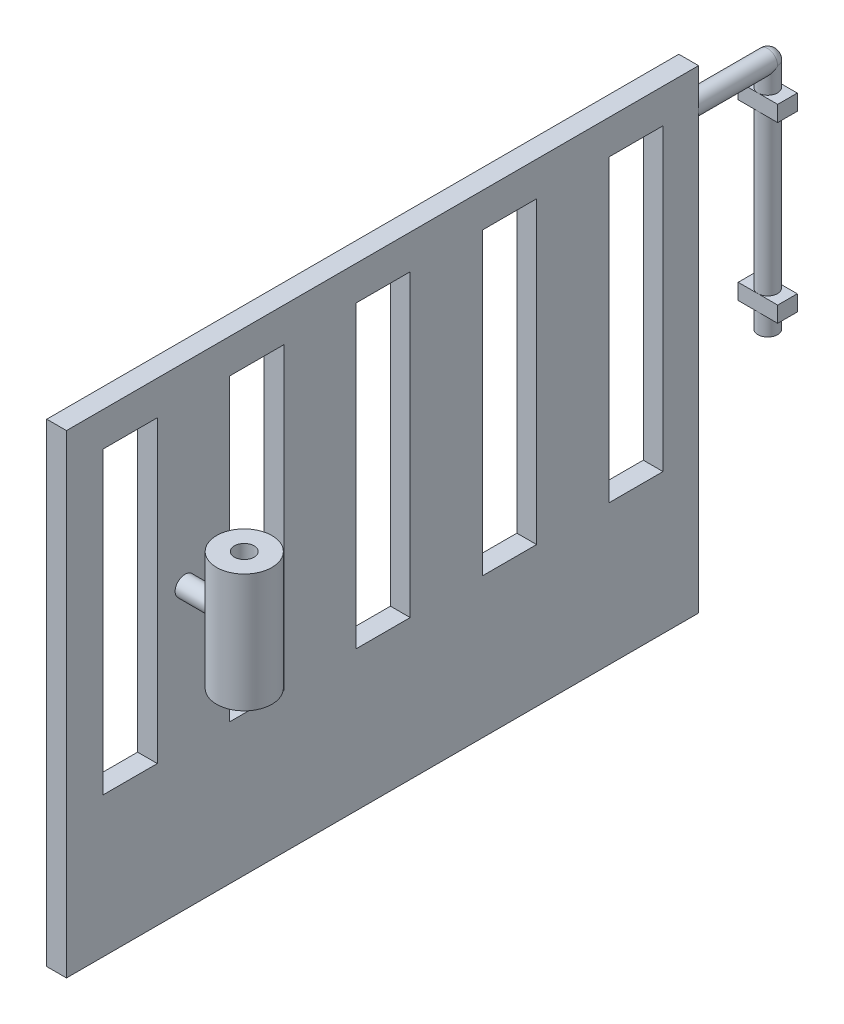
ISO-10303-21;
HEADER;
FILE_DESCRIPTION(('STEP AP214'),'2;1');
FILE_NAME('part.step','',(''),(''),'','','');
FILE_SCHEMA(('AUTOMOTIVE_DESIGN { 1 0 10303 214 1 1 1 1 }'));
ENDSEC;
DATA;
#1=APPLICATION_CONTEXT('core data for automotive mechanical design processes');
#2=APPLICATION_PROTOCOL_DEFINITION('international standard','automotive_design',2000,#1);
#3=PRODUCT_CONTEXT('',#1,'mechanical');
#4=PRODUCT('Part','Part','',(#3));
#5=PRODUCT_RELATED_PRODUCT_CATEGORY('part','',(#4));
#6=PRODUCT_DEFINITION_FORMATION('','',#4);
#7=PRODUCT_DEFINITION_CONTEXT('part definition',#1,'design');
#8=PRODUCT_DEFINITION('design','',#6,#7);
#9=PRODUCT_DEFINITION_SHAPE('','',#8);
#10=(LENGTH_UNIT() NAMED_UNIT(*) SI_UNIT(.MILLI.,.METRE.));
#11=(NAMED_UNIT(*) PLANE_ANGLE_UNIT() SI_UNIT($,.RADIAN.));
#12=(NAMED_UNIT(*) SI_UNIT($,.STERADIAN.) SOLID_ANGLE_UNIT());
#13=UNCERTAINTY_MEASURE_WITH_UNIT(LENGTH_MEASURE(1.E-05),#10,'distance_accuracy_value','');
#14=(GEOMETRIC_REPRESENTATION_CONTEXT(3) GLOBAL_UNCERTAINTY_ASSIGNED_CONTEXT((#13)) GLOBAL_UNIT_ASSIGNED_CONTEXT((#10,
#11,#12)) REPRESENTATION_CONTEXT('',''));
#15=CARTESIAN_POINT('',(0.,0.,0.));
#16=DIRECTION('',(0.,0.,1.));
#17=DIRECTION('',(1.,0.,0.));
#18=AXIS2_PLACEMENT_3D('',#15,#16,#17);
#19=CARTESIAN_POINT('',(20.,71.,130.));
#20=DIRECTION('',(-1.,0.,0.));
#21=DIRECTION('',(0.,-1.,0.));
#22=AXIS2_PLACEMENT_3D('',#19,#20,#21);
#23=CYLINDRICAL_SURFACE('',#22,2.5);
#24=CARTESIAN_POINT('',(5.,71.,130.));
#25=DIRECTION('',(-1.,0.,0.));
#26=DIRECTION('',(0.,-1.,0.));
#27=AXIS2_PLACEMENT_3D('',#24,#25,#26);
#28=CIRCLE('',#27,2.5);
#29=CARTESIAN_POINT('',(5.,68.5,130.));
#30=VERTEX_POINT('',#29);
#31=EDGE_CURVE('E41',#30,#30,#28,.F.);
#32=ORIENTED_EDGE('',*,*,#31,.T.);
#33=EDGE_LOOP('',(#32));
#34=FACE_BOUND('',#33,.T.);
#35=CARTESIAN_POINT('',(13.,68.5,130.));
#36=CARTESIAN_POINT('',(12.9999979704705,68.4999971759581,129.864160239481));
#37=CARTESIAN_POINT('',(13.0039894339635,68.5111067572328,129.728340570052));
#38=CARTESIAN_POINT('',(13.0195159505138,68.5550912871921,129.460735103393));
#39=CARTESIAN_POINT('',(13.0310507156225,68.5879654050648,129.328949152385));
#40=CARTESIAN_POINT('',(13.0604189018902,68.6741851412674,129.073307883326));
#41=CARTESIAN_POINT('',(13.0782408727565,68.7274935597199,128.949438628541));
#42=CARTESIAN_POINT('',(13.1183892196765,68.8528887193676,128.712404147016));
#43=CARTESIAN_POINT('',(13.1407166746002,68.924979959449,128.599241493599));
#44=CARTESIAN_POINT('',(13.1885262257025,69.0888431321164,128.382411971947));
#45=CARTESIAN_POINT('',(13.2140917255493,69.1812187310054,128.279219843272));
#46=CARTESIAN_POINT('',(13.2650647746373,69.3817463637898,128.089418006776));
#47=CARTESIAN_POINT('',(13.2904722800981,69.4899025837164,128.002812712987));
#48=CARTESIAN_POINT('',(13.3391992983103,69.7233977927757,127.845762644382));
#49=CARTESIAN_POINT('',(13.362418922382,69.8491947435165,127.775964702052));
#50=CARTESIAN_POINT('',(13.4028564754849,70.1117036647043,127.6587242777));
#51=CARTESIAN_POINT('',(13.4200765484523,70.2484117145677,127.611273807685));
#52=CARTESIAN_POINT('',(13.4456796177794,70.5234228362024,127.541908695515));
#53=CARTESIAN_POINT('',(13.45437266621,70.6614693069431,127.519094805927));
#54=CARTESIAN_POINT('',(13.4628493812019,70.9396836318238,127.496838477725));
#55=CARTESIAN_POINT('',(13.4626363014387,71.0798506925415,127.49738750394));
#56=CARTESIAN_POINT('',(13.453594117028,71.3503556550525,127.521149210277));
#57=CARTESIAN_POINT('',(13.4452263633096,71.4808183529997,127.543148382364));
#58=CARTESIAN_POINT('',(13.4215791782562,71.7360615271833,127.607191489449));
#59=CARTESIAN_POINT('',(13.4062988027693,71.8608412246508,127.649238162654));
#60=CARTESIAN_POINT('',(13.3702482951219,72.1037737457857,127.752904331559));
#61=CARTESIAN_POINT('',(13.3493855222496,72.2217696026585,127.814858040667));
#62=CARTESIAN_POINT('',(13.3045553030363,72.4460563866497,127.956347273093));
#63=CARTESIAN_POINT('',(13.2805868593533,72.5523435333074,128.035888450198));
#64=CARTESIAN_POINT('',(13.2304750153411,72.7569595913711,128.215968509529));
#65=CARTESIAN_POINT('',(13.2042877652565,72.8544178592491,128.317486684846));
#66=CARTESIAN_POINT('',(13.1539452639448,73.0311716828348,128.535738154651));
#67=CARTESIAN_POINT('',(13.1297902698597,73.1104649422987,128.652473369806));
#68=CARTESIAN_POINT('',(13.08583001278,73.2494806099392,128.899899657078));
#69=CARTESIAN_POINT('',(13.0660846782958,73.3089382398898,129.030750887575));
#70=CARTESIAN_POINT('',(13.0336083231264,73.4047158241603,129.301476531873));
#71=CARTESIAN_POINT('',(13.0208744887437,73.4410450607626,129.441347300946));
#72=CARTESIAN_POINT('',(13.0043379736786,73.4879191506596,129.718794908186));
#73=CARTESIAN_POINT('',(13.0001289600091,73.4996381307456,129.856149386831));
#74=CARTESIAN_POINT('',(12.9998770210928,73.5003451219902,130.130909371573));
#75=CARTESIAN_POINT('',(13.0038324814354,73.4893376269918,130.268314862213));
#76=CARTESIAN_POINT('',(13.0191965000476,73.4458138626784,130.534368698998));
#77=CARTESIAN_POINT('',(13.0303458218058,73.4140452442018,130.663155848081));
#78=CARTESIAN_POINT('',(13.0587175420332,73.3308634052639,130.91349944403));
#79=CARTESIAN_POINT('',(13.0759407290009,73.2794476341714,131.0350549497));
#80=CARTESIAN_POINT('',(13.1153426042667,73.1568411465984,131.271317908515));
#81=CARTESIAN_POINT('',(13.1376473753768,73.0851335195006,131.385735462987));
#82=CARTESIAN_POINT('',(13.184716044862,72.9245725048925,131.601279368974));
#83=CARTESIAN_POINT('',(13.2094807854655,72.8357132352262,131.70240114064));
#84=CARTESIAN_POINT('',(13.2603395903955,72.6378703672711,131.894022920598));
#85=CARTESIAN_POINT('',(13.286435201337,72.5280752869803,131.98368681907));
#86=CARTESIAN_POINT('',(13.3357212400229,72.2944587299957,132.143455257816));
#87=CARTESIAN_POINT('',(13.3589115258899,72.1706365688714,132.213558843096));
#88=CARTESIAN_POINT('',(13.3995966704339,71.9119351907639,132.332086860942));
#89=CARTESIAN_POINT('',(13.4170854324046,71.7770443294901,132.38048810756));
#90=CARTESIAN_POINT('',(13.4439855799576,71.5002398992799,132.453614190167));
#91=CARTESIAN_POINT('',(13.4534013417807,71.3583301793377,132.478351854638));
#92=CARTESIAN_POINT('',(13.4625440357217,71.080479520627,132.502362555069));
#93=CARTESIAN_POINT('',(13.462806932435,70.9446767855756,132.503044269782));
#94=CARTESIAN_POINT('',(13.4549668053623,70.6750023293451,132.482470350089));
#95=CARTESIAN_POINT('',(13.4468644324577,70.5411304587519,132.461216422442));
#96=CARTESIAN_POINT('',(13.4236329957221,70.2824994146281,132.398430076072));
#97=CARTESIAN_POINT('',(13.40868525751,70.1575959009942,132.357419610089));
#98=CARTESIAN_POINT('',(13.3735367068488,69.9163573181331,132.256726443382));
#99=CARTESIAN_POINT('',(13.3533346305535,69.8000243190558,132.197039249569));
#100=CARTESIAN_POINT('',(13.3087276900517,69.5730742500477,132.057303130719));
#101=CARTESIAN_POINT('',(13.2841659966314,69.4630119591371,131.976403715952));
#102=CARTESIAN_POINT('',(13.2341958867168,69.2575724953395,131.797908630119));
#103=CARTESIAN_POINT('',(13.2087872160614,69.162199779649,131.700307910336));
#104=CARTESIAN_POINT('',(13.1585455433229,68.9842780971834,131.485662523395));
#105=CARTESIAN_POINT('',(13.1337963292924,68.9025469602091,131.367917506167));
#106=CARTESIAN_POINT('',(13.0889507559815,68.7600923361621,131.119511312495));
#107=CARTESIAN_POINT('',(13.0688540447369,68.6993672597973,130.988851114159));
#108=CARTESIAN_POINT('',(13.0355399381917,68.6008596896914,130.717646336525));
#109=CARTESIAN_POINT('',(13.022351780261,68.5631745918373,130.577062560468));
#110=CARTESIAN_POINT('',(13.0045845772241,68.5127511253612,130.290976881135));
#111=CARTESIAN_POINT('',(13.0000021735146,68.5000030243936,130.145476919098));
#112=CARTESIAN_POINT('',(13.,68.5,130.));
#113=B_SPLINE_CURVE_WITH_KNOTS('',3,(#35,#36,#37,#38,#39,#40,#41,#42,#43,#44,#45,#46,#47,#48,
#49,#50,#51,#52,#53,#54,#55,#56,#57,#58,#59,#60,#61,#62,#63,#64,#65,#66,#67,#68,#69,#70,#71,#72,
#73,#74,#75,#76,#77,#78,#79,#80,#81,#82,#83,#84,#85,#86,#87,#88,#89,#90,#91,#92,#93,#94,#95,#96,
#97,#98,#99,#100,#101,#102,#103,#104,#105,#106,#107,#108,#109,#110,#111,#112),.UNSPECIFIED.,.T.,
.F.,(4,2,2,2,2,2,2,2,2,2,2,2,2,2,2,2,2,2,2,2,2,2,2,2,2,2,2,2,2,2,2,2,2,2,2,2,2,2,4),(0.,
0.406983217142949,0.813950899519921,1.22018120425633,1.62650889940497,2.04714572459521,
2.46789433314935,2.90289606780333,3.33774219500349,3.75611562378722,4.17433620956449,
4.57019246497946,4.96610280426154,5.36904149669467,5.77210990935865,6.19956653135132,
6.62707715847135,7.06008524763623,7.49291944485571,7.9045852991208,8.31616976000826,
8.71369326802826,9.11126840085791,9.52005856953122,9.92898918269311,10.3593838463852,
10.7897995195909,11.2206739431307,11.6513146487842,12.0566930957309,12.4620400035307,
12.8572208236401,13.2524967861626,13.6670344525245,14.0816976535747,14.5159343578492,
14.9501382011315,15.3861650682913,15.822021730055),.UNSPECIFIED.);
#114=CARTESIAN_POINT('',(13.,68.5,130.));
#115=VERTEX_POINT('',#114);
#116=EDGE_CURVE('E11',#115,#115,#113,.T.);
#117=ORIENTED_EDGE('',*,*,#116,.F.);
#118=EDGE_LOOP('',(#117));
#119=FACE_BOUND('',#118,.T.);
#120=ADVANCED_FACE('F32',(#34,#119),#23,.T.);
#121=CARTESIAN_POINT('',(5.,0.,160.));
#122=DIRECTION('',(-1.,0.,0.));
#123=DIRECTION('',(0.,-1.,0.));
#124=AXIS2_PLACEMENT_3D('',#121,#122,#123);
#125=PLANE('',#124);
#126=DIRECTION('',(0.,1.,0.));
#127=VECTOR('',#126,1.);
#128=CARTESIAN_POINT('',(5.,0.,150.726497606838));
#129=LINE('',#128,#127);
#130=CARTESIAN_POINT('',(5.,35.510680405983,150.726497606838));
#131=VERTEX_POINT('',#130);
#132=CARTESIAN_POINT('',(5.,111.318383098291,150.726497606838));
#133=VERTEX_POINT('',#132);
#134=EDGE_CURVE('E320',#131,#133,#129,.T.);
#135=ORIENTED_EDGE('',*,*,#134,.T.);
#136=DIRECTION('',(0.,0.,-1.));
#137=VECTOR('',#136,1.);
#138=CARTESIAN_POINT('',(5.,111.318383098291,160.));
#139=LINE('',#138,#137);
#140=CARTESIAN_POINT('',(5.,111.318383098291,137.));
#141=VERTEX_POINT('',#140);
#142=EDGE_CURVE('E323',#133,#141,#139,.T.);
#143=ORIENTED_EDGE('',*,*,#142,.T.);
#144=DIRECTION('',(0.,-1.,0.));
#145=VECTOR('',#144,1.);
#146=CARTESIAN_POINT('',(5.,0.,137.));
#147=LINE('',#146,#145);
#148=CARTESIAN_POINT('',(5.,35.510680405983,137.));
#149=VERTEX_POINT('',#148);
#150=EDGE_CURVE('E315',#141,#149,#147,.T.);
#151=ORIENTED_EDGE('',*,*,#150,.T.);
#152=DIRECTION('',(0.,0.,1.));
#153=VECTOR('',#152,1.);
#154=CARTESIAN_POINT('',(5.,35.510680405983,160.));
#155=LINE('',#154,#153);
#156=EDGE_CURVE('E296',#149,#131,#155,.T.);
#157=ORIENTED_EDGE('',*,*,#156,.T.);
#158=EDGE_LOOP('',(#135,#143,#151,#157));
#159=FACE_BOUND('',#158,.T.);
#160=DIRECTION('',(0.,1.,0.));
#161=VECTOR('',#160,1.);
#162=CARTESIAN_POINT('',(5.,0.,118.726497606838));
#163=LINE('',#162,#161);
#164=CARTESIAN_POINT('',(5.,35.510680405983,118.726497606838));
#165=VERTEX_POINT('',#164);
#166=CARTESIAN_POINT('',(5.,111.318383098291,118.726497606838));
#167=VERTEX_POINT('',#166);
#168=EDGE_CURVE('E352',#165,#167,#163,.T.);
#169=ORIENTED_EDGE('',*,*,#168,.T.);
#170=DIRECTION('',(0.,0.,-1.));
#171=VECTOR('',#170,1.);
#172=CARTESIAN_POINT('',(5.,111.318383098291,160.));
#173=LINE('',#172,#171);
#174=CARTESIAN_POINT('',(5.,111.318383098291,105.));
#175=VERTEX_POINT('',#174);
#176=EDGE_CURVE('E355',#167,#175,#173,.T.);
#177=ORIENTED_EDGE('',*,*,#176,.T.);
#178=DIRECTION('',(0.,-1.,0.));
#179=VECTOR('',#178,1.);
#180=CARTESIAN_POINT('',(5.,0.,105.));
#181=LINE('',#180,#179);
#182=CARTESIAN_POINT('',(5.,35.510680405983,105.));
#183=VERTEX_POINT('',#182);
#184=EDGE_CURVE('E340',#175,#183,#181,.T.);
#185=ORIENTED_EDGE('',*,*,#184,.T.);
#186=DIRECTION('',(0.,0.,1.));
#187=VECTOR('',#186,1.);
#188=CARTESIAN_POINT('',(5.,35.510680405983,160.));
#189=LINE('',#188,#187);
#190=EDGE_CURVE('E349',#183,#165,#189,.T.);
#191=ORIENTED_EDGE('',*,*,#190,.T.);
#192=EDGE_LOOP('',(#169,#177,#185,#191));
#193=FACE_BOUND('',#192,.T.);
#194=DIRECTION('',(0.,1.,0.));
#195=VECTOR('',#194,1.);
#196=CARTESIAN_POINT('',(5.,0.,86.7264976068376));
#197=LINE('',#196,#195);
#198=CARTESIAN_POINT('',(5.,35.510680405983,86.7264976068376));
#199=VERTEX_POINT('',#198);
#200=CARTESIAN_POINT('',(5.,111.318383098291,86.7264976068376));
#201=VERTEX_POINT('',#200);
#202=EDGE_CURVE('E384',#199,#201,#197,.T.);
#203=ORIENTED_EDGE('',*,*,#202,.T.);
#204=DIRECTION('',(0.,0.,-1.));
#205=VECTOR('',#204,1.);
#206=CARTESIAN_POINT('',(5.,111.318383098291,160.));
#207=LINE('',#206,#205);
#208=CARTESIAN_POINT('',(5.,111.318383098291,73.));
#209=VERTEX_POINT('',#208);
#210=EDGE_CURVE('E387',#201,#209,#207,.T.);
#211=ORIENTED_EDGE('',*,*,#210,.T.);
#212=DIRECTION('',(0.,-1.,0.));
#213=VECTOR('',#212,1.);
#214=CARTESIAN_POINT('',(5.,0.,73.));
#215=LINE('',#214,#213);
#216=CARTESIAN_POINT('',(5.,35.510680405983,73.));
#217=VERTEX_POINT('',#216);
#218=EDGE_CURVE('E372',#209,#217,#215,.T.);
#219=ORIENTED_EDGE('',*,*,#218,.T.);
#220=DIRECTION('',(0.,0.,1.));
#221=VECTOR('',#220,1.);
#222=CARTESIAN_POINT('',(5.,35.510680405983,160.));
#223=LINE('',#222,#221);
#224=EDGE_CURVE('E381',#217,#199,#223,.T.);
#225=ORIENTED_EDGE('',*,*,#224,.T.);
#226=EDGE_LOOP('',(#203,#211,#219,#225));
#227=FACE_BOUND('',#226,.T.);
#228=DIRECTION('',(0.,1.,0.));
#229=VECTOR('',#228,1.);
#230=CARTESIAN_POINT('',(5.,0.,54.7264976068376));
#231=LINE('',#230,#229);
#232=CARTESIAN_POINT('',(5.,35.510680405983,54.7264976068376));
#233=VERTEX_POINT('',#232);
#234=CARTESIAN_POINT('',(5.,111.318383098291,54.7264976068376));
#235=VERTEX_POINT('',#234);
#236=EDGE_CURVE('E416',#233,#235,#231,.T.);
#237=ORIENTED_EDGE('',*,*,#236,.T.);
#238=DIRECTION('',(0.,0.,-1.));
#239=VECTOR('',#238,1.);
#240=CARTESIAN_POINT('',(5.,111.318383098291,160.));
#241=LINE('',#240,#239);
#242=CARTESIAN_POINT('',(5.,111.318383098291,41.));
#243=VERTEX_POINT('',#242);
#244=EDGE_CURVE('E419',#235,#243,#241,.T.);
#245=ORIENTED_EDGE('',*,*,#244,.T.);
#246=DIRECTION('',(0.,-1.,0.));
#247=VECTOR('',#246,1.);
#248=CARTESIAN_POINT('',(5.,0.,41.));
#249=LINE('',#248,#247);
#250=CARTESIAN_POINT('',(5.,35.510680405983,41.));
#251=VERTEX_POINT('',#250);
#252=EDGE_CURVE('E404',#243,#251,#249,.T.);
#253=ORIENTED_EDGE('',*,*,#252,.T.);
#254=DIRECTION('',(0.,0.,1.));
#255=VECTOR('',#254,1.);
#256=CARTESIAN_POINT('',(5.,35.510680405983,160.));
#257=LINE('',#256,#255);
#258=EDGE_CURVE('E413',#251,#233,#257,.T.);
#259=ORIENTED_EDGE('',*,*,#258,.T.);
#260=EDGE_LOOP('',(#237,#245,#253,#259));
#261=FACE_BOUND('',#260,.T.);
#262=DIRECTION('',(0.,0.,-1.));
#263=VECTOR('',#262,1.);
#264=CARTESIAN_POINT('',(5.,111.318383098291,160.));
#265=LINE('',#264,#263);
#266=CARTESIAN_POINT('',(5.,111.318383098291,22.7264976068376));
#267=VERTEX_POINT('',#266);
#268=CARTESIAN_POINT('',(5.,111.318383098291,9.));
#269=VERTEX_POINT('',#268);
#270=EDGE_CURVE('E448',#267,#269,#265,.T.);
#271=ORIENTED_EDGE('',*,*,#270,.T.);
#272=DIRECTION('',(0.,-1.,0.));
#273=VECTOR('',#272,1.);
#274=CARTESIAN_POINT('',(5.,0.,9.00000000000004));
#275=LINE('',#274,#273);
#276=CARTESIAN_POINT('',(5.,35.510680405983,9.00000000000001));
#277=VERTEX_POINT('',#276);
#278=EDGE_CURVE('E451',#269,#277,#275,.T.);
#279=ORIENTED_EDGE('',*,*,#278,.T.);
#280=DIRECTION('',(0.,0.,1.));
#281=VECTOR('',#280,1.);
#282=CARTESIAN_POINT('',(5.,35.510680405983,160.));
#283=LINE('',#282,#281);
#284=CARTESIAN_POINT('',(5.,35.510680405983,22.7264976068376));
#285=VERTEX_POINT('',#284);
#286=EDGE_CURVE('E436',#277,#285,#283,.T.);
#287=ORIENTED_EDGE('',*,*,#286,.T.);
#288=DIRECTION('',(0.,1.,0.));
#289=VECTOR('',#288,1.);
#290=CARTESIAN_POINT('',(5.,0.,22.7264976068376));
#291=LINE('',#290,#289);
#292=EDGE_CURVE('E445',#285,#267,#291,.T.);
#293=ORIENTED_EDGE('',*,*,#292,.T.);
#294=EDGE_LOOP('',(#271,#279,#287,#293));
#295=FACE_BOUND('',#294,.T.);
#296=DIRECTION('',(0.,1.,0.));
#297=VECTOR('',#296,1.);
#298=CARTESIAN_POINT('',(5.,0.,0.));
#299=LINE('',#298,#297);
#300=CARTESIAN_POINT('',(5.,0.,0.));
#301=VERTEX_POINT('',#300);
#302=CARTESIAN_POINT('',(5.,110.,0.));
#303=VERTEX_POINT('',#302);
#304=EDGE_CURVE('E661',#301,#303,#299,.T.);
#305=ORIENTED_EDGE('',*,*,#304,.T.);
#306=CARTESIAN_POINT('',(5.,120.,0.));
#307=VERTEX_POINT('',#306);
#308=EDGE_CURVE('E660',#303,#307,#299,.T.);
#309=ORIENTED_EDGE('',*,*,#308,.T.);
#310=DIRECTION('',(0.,0.,-1.));
#311=VECTOR('',#310,1.);
#312=CARTESIAN_POINT('',(5.,120.,160.));
#313=LINE('',#312,#311);
#314=CARTESIAN_POINT('',(5.,120.,160.));
#315=VERTEX_POINT('',#314);
#316=EDGE_CURVE('E678',#315,#307,#313,.T.);
#317=ORIENTED_EDGE('',*,*,#316,.F.);
#318=DIRECTION('',(0.,1.,0.));
#319=VECTOR('',#318,1.);
#320=CARTESIAN_POINT('',(5.,0.,160.));
#321=LINE('',#320,#319);
#322=CARTESIAN_POINT('',(5.,0.,160.));
#323=VERTEX_POINT('',#322);
#324=EDGE_CURVE('E671',#323,#315,#321,.T.);
#325=ORIENTED_EDGE('',*,*,#324,.F.);
#326=DIRECTION('',(0.,0.,-1.));
#327=VECTOR('',#326,1.);
#328=CARTESIAN_POINT('',(5.,0.,160.));
#329=LINE('',#328,#327);
#330=EDGE_CURVE('E681',#323,#301,#329,.T.);
#331=ORIENTED_EDGE('',*,*,#330,.T.);
#332=EDGE_LOOP('',(#305,#309,#317,#325,#331));
#333=FACE_BOUND('',#332,.T.);
#334=ORIENTED_EDGE('',*,*,#31,.F.);
#335=EDGE_LOOP('',(#334));
#336=FACE_BOUND('',#335,.T.);
#337=ADVANCED_FACE('F598',(#159,#193,#227,#261,#295,#333,#336),#125,.F.);
#338=CARTESIAN_POINT('',(7.49999999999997,56.,-22.4792139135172));
#339=DIRECTION('',(0.,1.,0.));
#340=DIRECTION('',(0.,0.,1.));
#341=AXIS2_PLACEMENT_3D('',#338,#339,#340);
#342=PLANE('',#341);
#343=CARTESIAN_POINT('',(2.49999999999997,56.,-19.9999999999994));
#344=DIRECTION('',(0.,-1.,0.));
#345=DIRECTION('',(0.,0.,-1.));
#346=AXIS2_PLACEMENT_3D('',#343,#344,#345);
#347=CIRCLE('',#346,2.47921391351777);
#348=CARTESIAN_POINT('',(2.49999999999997,56.,-22.4792139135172));
#349=VERTEX_POINT('',#348);
#350=CARTESIAN_POINT('',(2.49999999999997,56.,-17.5207860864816));
#351=VERTEX_POINT('',#350);
#352=EDGE_CURVE('E463',#349,#351,#347,.T.);
#353=ORIENTED_EDGE('',*,*,#352,.F.);
#354=DIRECTION('',(1.,0.,0.));
#355=VECTOR('',#354,1.);
#356=CARTESIAN_POINT('',(7.49999999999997,56.,-22.4792139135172));
#357=LINE('',#356,#355);
#358=CARTESIAN_POINT('',(7.49999999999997,56.,-22.4792139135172));
#359=VERTEX_POINT('',#358);
#360=EDGE_CURVE('E492',#349,#359,#357,.T.);
#361=ORIENTED_EDGE('',*,*,#360,.T.);
#362=DIRECTION('',(0.,0.,1.));
#363=VECTOR('',#362,1.);
#364=CARTESIAN_POINT('',(7.49999999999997,56.,-17.5207860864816));
#365=LINE('',#364,#363);
#366=CARTESIAN_POINT('',(7.49999999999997,56.,-17.5207860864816));
#367=VERTEX_POINT('',#366);
#368=EDGE_CURVE('E483',#359,#367,#365,.T.);
#369=ORIENTED_EDGE('',*,*,#368,.T.);
#370=DIRECTION('',(-1.,0.,0.));
#371=VECTOR('',#370,1.);
#372=CARTESIAN_POINT('',(7.49999999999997,56.,-17.5207860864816));
#373=LINE('',#372,#371);
#374=EDGE_CURVE('E487',#367,#351,#373,.T.);
#375=ORIENTED_EDGE('',*,*,#374,.T.);
#376=EDGE_LOOP('',(#353,#361,#369,#375));
#377=FACE_BOUND('',#376,.T.);
#378=ADVANCED_FACE('F604',(#377),#342,.F.);
#379=EDGE_CURVE('E467',#351,#349,#347,.T.);
#380=ORIENTED_EDGE('',*,*,#379,.F.);
#381=CARTESIAN_POINT('',(-2.50000000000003,56.,-17.5207860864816));
#382=VERTEX_POINT('',#381);
#383=EDGE_CURVE('E486',#351,#382,#373,.T.);
#384=ORIENTED_EDGE('',*,*,#383,.T.);
#385=DIRECTION('',(0.,0.,-1.));
#386=VECTOR('',#385,1.);
#387=CARTESIAN_POINT('',(-2.50000000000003,56.,-17.5207860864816));
#388=LINE('',#387,#386);
#389=CARTESIAN_POINT('',(-2.50000000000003,56.,-22.4792139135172));
#390=VERTEX_POINT('',#389);
#391=EDGE_CURVE('E490',#382,#390,#388,.T.);
#392=ORIENTED_EDGE('',*,*,#391,.T.);
#393=EDGE_CURVE('E493',#390,#349,#357,.T.);
#394=ORIENTED_EDGE('',*,*,#393,.T.);
#395=EDGE_LOOP('',(#380,#384,#392,#394));
#396=FACE_BOUND('',#395,.T.);
#397=ADVANCED_FACE('F851',(#396),#342,.F.);
#398=CARTESIAN_POINT('',(2.49999999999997,100.,-19.9999999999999));
#399=DIRECTION('',(0.,-1.,0.));
#400=DIRECTION('',(0.,0.,-1.));
#401=AXIS2_PLACEMENT_3D('',#398,#399,#400);
#402=PLANE('',#401);
#403=CARTESIAN_POINT('',(2.49999999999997,100.,-19.9999999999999));
#404=DIRECTION('',(0.,-1.,0.));
#405=DIRECTION('',(0.,0.,-1.));
#406=AXIS2_PLACEMENT_3D('',#403,#404,#405);
#407=CIRCLE('',#406,2.47921391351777);
#408=CARTESIAN_POINT('',(2.49999999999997,100.,-22.4792139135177));
#409=VERTEX_POINT('',#408);
#410=CARTESIAN_POINT('',(2.49999999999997,100.,-17.5207860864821));
#411=VERTEX_POINT('',#410);
#412=EDGE_CURVE('E507',#409,#411,#407,.T.);
#413=ORIENTED_EDGE('',*,*,#412,.F.);
#414=DIRECTION('',(1.,0.,0.));
#415=VECTOR('',#414,1.);
#416=CARTESIAN_POINT('',(7.49999999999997,100.,-22.4792139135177));
#417=LINE('',#416,#415);
#418=CARTESIAN_POINT('',(7.49999999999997,100.,-22.4792139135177));
#419=VERTEX_POINT('',#418);
#420=EDGE_CURVE('E525',#409,#419,#417,.T.);
#421=ORIENTED_EDGE('',*,*,#420,.T.);
#422=DIRECTION('',(0.,0.,1.));
#423=VECTOR('',#422,1.);
#424=CARTESIAN_POINT('',(7.49999999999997,100.,-17.5207860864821));
#425=LINE('',#424,#423);
#426=CARTESIAN_POINT('',(7.49999999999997,100.,-17.5207860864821));
#427=VERTEX_POINT('',#426);
#428=EDGE_CURVE('E515',#419,#427,#425,.T.);
#429=ORIENTED_EDGE('',*,*,#428,.T.);
#430=DIRECTION('',(-1.,0.,0.));
#431=VECTOR('',#430,1.);
#432=CARTESIAN_POINT('',(7.49999999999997,100.,-17.5207860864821));
#433=LINE('',#432,#431);
#434=EDGE_CURVE('E519',#427,#411,#433,.T.);
#435=ORIENTED_EDGE('',*,*,#434,.T.);
#436=EDGE_LOOP('',(#413,#421,#429,#435));
#437=FACE_BOUND('',#436,.T.);
#438=ADVANCED_FACE('F594',(#437),#402,.T.);
#439=CARTESIAN_POINT('',(2.5,110.,-20.));
#440=DIRECTION('',(0.,0.,1.));
#441=DIRECTION('',(1.,0.,0.));
#442=AXIS2_PLACEMENT_3D('',#439,#440,#441);
#443=CYLINDRICAL_SURFACE('',#442,2.5);
#444=CARTESIAN_POINT('',(2.5,110.,0.));
#445=DIRECTION('',(0.,0.,-1.));
#446=DIRECTION('',(-1.,0.,0.));
#447=AXIS2_PLACEMENT_3D('',#444,#445,#446);
#448=CIRCLE('',#447,2.5);
#449=CARTESIAN_POINT('',(0.,110.,0.));
#450=VERTEX_POINT('',#449);
#451=EDGE_CURVE('E630',#450,#303,#448,.T.);
#452=ORIENTED_EDGE('',*,*,#451,.T.);
#453=EDGE_CURVE('E654',#303,#450,#448,.T.);
#454=ORIENTED_EDGE('',*,*,#453,.T.);
#455=EDGE_LOOP('',(#452,#454));
#456=FACE_BOUND('',#455,.T.);
#457=CARTESIAN_POINT('',(2.49999999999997,107.5,-17.5207860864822));
#458=CARTESIAN_POINT('',(2.38907425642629,107.500007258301,-17.5207933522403));
#459=CARTESIAN_POINT('',(2.27808997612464,107.507446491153,-17.5282944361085));
#460=CARTESIAN_POINT('',(2.05993871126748,107.53656782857,-17.5576643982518));
#461=CARTESIAN_POINT('',(1.95277582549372,107.558264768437,-17.5795482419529));
#462=CARTESIAN_POINT('',(1.74606025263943,107.614005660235,-17.6357909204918));
#463=CARTESIAN_POINT('',(1.64646193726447,107.647967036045,-17.6700663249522));
#464=CARTESIAN_POINT('',(1.45587592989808,107.726140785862,-17.7490074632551));
#465=CARTESIAN_POINT('',(1.3648907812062,107.770356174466,-17.7936762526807));
#466=CARTESIAN_POINT('',(1.15698032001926,107.886774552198,-17.9113814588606));
#467=CARTESIAN_POINT('',(1.04466889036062,107.963027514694,-17.988547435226));
#468=CARTESIAN_POINT('',(0.838747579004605,108.12712498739,-18.1549108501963));
#469=CARTESIAN_POINT('',(0.745192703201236,108.215002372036,-18.2441424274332));
#470=CARTESIAN_POINT('',(0.602184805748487,108.37034957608,-18.4023729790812));
#471=CARTESIAN_POINT('',(0.548008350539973,108.43580623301,-18.4691775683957));
#472=CARTESIAN_POINT('',(0.447960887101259,108.569575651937,-18.6061439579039));
#473=CARTESIAN_POINT('',(0.402094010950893,108.637889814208,-18.6763074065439));
#474=CARTESIAN_POINT('',(0.318473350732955,108.776291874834,-18.8192040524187));
#475=CARTESIAN_POINT('',(0.280698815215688,108.846374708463,-18.8919301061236));
#476=CARTESIAN_POINT('',(0.212826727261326,108.987594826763,-19.0398110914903));
#477=CARTESIAN_POINT('',(0.182725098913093,109.058731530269,-19.1149647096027));
#478=CARTESIAN_POINT('',(0.139167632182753,109.176044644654,-19.2412229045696));
#479=CARTESIAN_POINT('',(0.123569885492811,109.222261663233,-19.2915598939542));
#480=CARTESIAN_POINT('',(0.0954199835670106,109.314200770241,-19.3939254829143));
#481=CARTESIAN_POINT('',(0.0828813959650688,109.359919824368,-19.4459604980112));
#482=CARTESIAN_POINT('',(0.0608266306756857,109.449942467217,-19.5528224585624));
#483=CARTESIAN_POINT('',(0.0513395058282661,109.494229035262,-19.6076707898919));
#484=CARTESIAN_POINT('',(0.0396508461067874,109.556008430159,-19.6934057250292));
#485=CARTESIAN_POINT('',(0.0361853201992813,109.575770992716,-19.7224633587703));
#486=CARTESIAN_POINT('',(0.0301678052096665,109.612361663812,-19.7824255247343));
#487=CARTESIAN_POINT('',(0.0276123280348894,109.62920084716,-19.8133224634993));
#488=CARTESIAN_POINT('',(0.0243787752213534,109.651609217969,-19.8651523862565));
#489=CARTESIAN_POINT('',(0.0233574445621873,109.659008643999,-19.8852433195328));
#490=CARTESIAN_POINT('',(0.0217971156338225,109.670538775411,-19.9263071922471));
#491=CARTESIAN_POINT('',(0.0212557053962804,109.67468581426,-19.9472751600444));
#492=CARTESIAN_POINT('',(0.0207143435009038,109.678832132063,-19.9899114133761));
#493=CARTESIAN_POINT('',(0.0207209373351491,109.678781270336,-20.0115850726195));
#494=CARTESIAN_POINT('',(0.0212919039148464,109.674408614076,-20.0545199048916));
#495=CARTESIAN_POINT('',(0.0218580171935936,109.670073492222,-20.0757795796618));
#496=CARTESIAN_POINT('',(0.0237976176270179,109.655778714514,-20.1255899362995));
#497=CARTESIAN_POINT('',(0.0254033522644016,109.644263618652,-20.1536588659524));
#498=CARTESIAN_POINT('',(0.029376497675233,109.617632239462,-20.2080097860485));
#499=CARTESIAN_POINT('',(0.0317478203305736,109.602497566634,-20.2342817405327));
#500=CARTESIAN_POINT('',(0.0401196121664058,109.552631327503,-20.3137515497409));
#501=CARTESIAN_POINT('',(0.0472412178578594,109.514670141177,-20.36474726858));
#502=CARTESIAN_POINT('',(0.0641069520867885,109.436004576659,-20.4641614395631));
#503=CARTESIAN_POINT('',(0.0738586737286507,109.39529251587,-20.5125719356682));
#504=CARTESIAN_POINT('',(0.0959943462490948,109.312546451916,-20.6080023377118));
#505=CARTESIAN_POINT('',(0.108388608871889,109.270507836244,-20.6550159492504));
#506=CARTESIAN_POINT('',(0.135776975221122,109.186106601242,-20.7478545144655));
#507=CARTESIAN_POINT('',(0.150767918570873,109.143744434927,-20.793680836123));
#508=CARTESIAN_POINT('',(0.197080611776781,109.02351793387,-20.9224592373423));
#509=CARTESIAN_POINT('',(0.231555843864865,108.945669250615,-21.0043214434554));
#510=CARTESIAN_POINT('',(0.309801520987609,108.791477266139,-21.1651283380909));
#511=CARTESIAN_POINT('',(0.35358052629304,108.715135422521,-21.2440702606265));
#512=CARTESIAN_POINT('',(0.450676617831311,108.565353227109,-21.3982295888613));
#513=CARTESIAN_POINT('',(0.503962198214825,108.491904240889,-21.4734582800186));
#514=CARTESIAN_POINT('',(0.620568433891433,108.348865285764,-21.6195570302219));
#515=CARTESIAN_POINT('',(0.683880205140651,108.279271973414,-21.6904308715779));
#516=CARTESIAN_POINT('',(0.834671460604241,108.131872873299,-21.8402764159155));
#517=CARTESIAN_POINT('',(0.924453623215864,108.055178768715,-21.9180632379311));
#518=CARTESIAN_POINT('',(1.11958843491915,107.912165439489,-22.0629315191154));
#519=CARTESIAN_POINT('',(1.22492034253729,107.845832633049,-22.1300269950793));
#520=CARTESIAN_POINT('',(1.42998510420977,107.738164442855,-22.2388505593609));
#521=CARTESIAN_POINT('',(1.52719355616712,107.694475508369,-22.2829744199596));
#522=CARTESIAN_POINT('',(1.73055087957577,107.61888970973,-22.3592827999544));
#523=CARTESIAN_POINT('',(1.83669451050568,107.586985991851,-22.3914742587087));
#524=CARTESIAN_POINT('',(2.05641291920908,107.537074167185,-22.4418264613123));
#525=CARTESIAN_POINT('',(2.17003930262,107.51917663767,-22.4598755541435));
#526=CARTESIAN_POINT('',(2.40006230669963,107.499338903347,-22.4798809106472));
#527=CARTESIAN_POINT('',(2.51645699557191,107.49738788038,-22.4818480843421));
#528=CARTESIAN_POINT('',(2.73264656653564,107.508800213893,-22.4703397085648));
#529=CARTESIAN_POINT('',(2.8326597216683,107.520235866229,-22.4588080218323));
#530=CARTESIAN_POINT('',(3.02863429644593,107.554505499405,-22.4242421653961));
#531=CARTESIAN_POINT('',(3.12459512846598,107.577341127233,-22.401206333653));
#532=CARTESIAN_POINT('',(3.31267650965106,107.633686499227,-22.3443455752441));
#533=CARTESIAN_POINT('',(3.40464530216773,107.667444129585,-22.3102700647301));
#534=CARTESIAN_POINT('',(3.58086840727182,107.743685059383,-22.2332684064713));
#535=CARTESIAN_POINT('',(3.66511998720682,107.786171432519,-22.1903391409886));
#536=CARTESIAN_POINT('',(3.86719804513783,107.902252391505,-22.0729588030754));
#537=CARTESIAN_POINT('',(3.97959235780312,107.980508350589,-21.9937511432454));
#538=CARTESIAN_POINT('',(4.18526101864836,108.14861273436,-21.823277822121));
#539=CARTESIAN_POINT('',(4.27847012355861,108.238499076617,-21.7319726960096));
#540=CARTESIAN_POINT('',(4.42049176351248,108.397100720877,-21.5703339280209));
#541=CARTESIAN_POINT('',(4.47413989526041,108.463819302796,-21.5021927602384));
#542=CARTESIAN_POINT('',(4.572976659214,108.600052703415,-21.3625679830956));
#543=CARTESIAN_POINT('',(4.61816096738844,108.669568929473,-21.2910826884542));
#544=CARTESIAN_POINT('',(4.70023663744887,108.810224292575,-21.145605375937));
#545=CARTESIAN_POINT('',(4.73715608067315,108.881357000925,-21.0716228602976));
#546=CARTESIAN_POINT('',(4.80318600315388,109.024533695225,-20.9211892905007));
#547=CARTESIAN_POINT('',(4.83230092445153,109.096577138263,-20.8447396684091));
#548=CARTESIAN_POINT('',(4.87326819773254,109.212721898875,-20.7187856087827));
#549=CARTESIAN_POINT('',(4.88746289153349,109.256965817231,-20.6701653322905));
#550=CARTESIAN_POINT('',(4.91307735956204,109.344887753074,-20.5711323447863));
#551=CARTESIAN_POINT('',(4.92447885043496,109.388560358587,-20.5207101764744));
#552=CARTESIAN_POINT('',(4.94451029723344,109.474362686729,-20.4168144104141));
#553=CARTESIAN_POINT('',(4.95310402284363,109.51646646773,-20.3633106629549));
#554=CARTESIAN_POINT('',(4.96357247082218,109.574323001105,-20.2794413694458));
#555=CARTESIAN_POINT('',(4.96664899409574,109.5926481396,-20.2510307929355));
#556=CARTESIAN_POINT('',(4.97192067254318,109.625987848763,-20.1922932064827));
#557=CARTESIAN_POINT('',(4.97412005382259,109.641018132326,-20.1619762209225));
#558=CARTESIAN_POINT('',(4.97677981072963,109.659975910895,-20.1114479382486));
#559=CARTESIAN_POINT('',(4.9775838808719,109.665939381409,-20.0920495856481));
#560=CARTESIAN_POINT('',(4.97873468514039,109.674586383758,-20.0525630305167));
#561=CARTESIAN_POINT('',(4.97908335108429,109.677283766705,-20.0324781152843));
#562=CARTESIAN_POINT('',(4.97928397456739,109.678826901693,-19.9920165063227));
#563=CARTESIAN_POINT('',(4.97913270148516,109.677647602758,-19.9716387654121));
#564=CARTESIAN_POINT('',(4.97834697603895,109.671664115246,-19.9313984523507));
#565=CARTESIAN_POINT('',(4.97771081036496,109.666847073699,-19.9115379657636));
#566=CARTESIAN_POINT('',(4.97552078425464,109.650872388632,-19.8612200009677));
#567=CARTESIAN_POINT('',(4.97364641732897,109.637648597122,-19.8314640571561));
#568=CARTESIAN_POINT('',(4.96905276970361,109.60755023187,-19.7739079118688));
#569=CARTESIAN_POINT('',(4.96632924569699,109.590657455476,-19.7461184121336));
#570=CARTESIAN_POINT('',(4.95637995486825,109.533338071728,-19.6588414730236));
#571=CARTESIAN_POINT('',(4.9477096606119,109.4892981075,-19.6019519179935));
#572=CARTESIAN_POINT('',(4.92703524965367,109.398558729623,-19.4909271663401));
#573=CARTESIAN_POINT('',(4.91502184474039,109.351852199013,-19.4368001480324));
#574=CARTESIAN_POINT('',(4.88762651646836,109.25726007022,-19.3300837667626));
#575=CARTESIAN_POINT('',(4.87223318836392,109.209370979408,-19.2775003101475));
#576=CARTESIAN_POINT('',(4.83809169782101,109.113476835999,-19.1736788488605));
#577=CARTESIAN_POINT('',(4.81934733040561,109.065471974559,-19.1224393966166));
#578=CARTESIAN_POINT('',(4.76684248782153,108.942612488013,-18.9923999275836));
#579=CARTESIAN_POINT('',(4.73058768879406,108.867939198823,-18.9144151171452));
#580=CARTESIAN_POINT('',(4.64931858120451,108.72033505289,-18.7612726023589));
#581=CARTESIAN_POINT('',(4.60429740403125,108.647405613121,-18.6861171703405));
#582=CARTESIAN_POINT('',(4.50526970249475,108.504532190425,-18.5394522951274));
#583=CARTESIAN_POINT('',(4.45129091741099,108.434579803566,-18.4679324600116));
#584=CARTESIAN_POINT('',(4.33389084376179,108.29855640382,-18.3291929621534));
#585=CARTESIAN_POINT('',(4.27047732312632,108.232482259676,-18.261969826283));
#586=CARTESIAN_POINT('',(4.11895813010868,108.091631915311,-18.1188936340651));
#587=CARTESIAN_POINT('',(4.02847857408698,108.018066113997,-18.0443203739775));
#588=CARTESIAN_POINT('',(3.83256818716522,107.881395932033,-17.9059366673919));
#589=CARTESIAN_POINT('',(3.72715472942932,107.818279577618,-17.8421139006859));
#590=CARTESIAN_POINT('',(3.52204849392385,107.716120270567,-17.7388824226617));
#591=CARTESIAN_POINT('',(3.42467716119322,107.674792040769,-17.6971501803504));
#592=CARTESIAN_POINT('',(3.22158548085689,107.603998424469,-17.6256897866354));
#593=CARTESIAN_POINT('',(3.11587810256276,107.574515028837,-17.5959434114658));
#594=CARTESIAN_POINT('',(2.92502338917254,107.534959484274,-17.5560418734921));
#595=CARTESIAN_POINT('',(2.84111032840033,107.521913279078,-17.5428844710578));
#596=CARTESIAN_POINT('',(2.67147652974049,107.504430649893,-17.5252536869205));
#597=CARTESIAN_POINT('',(2.58575575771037,107.499994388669,-17.5207804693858));
#598=CARTESIAN_POINT('',(2.49999999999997,107.5,-17.5207860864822));
#599=B_SPLINE_CURVE_WITH_KNOTS('',3,(#457,#458,#459,#460,#461,#462,#463,#464,#465,#466,#467,
#468,#469,#470,#471,#472,#473,#474,#475,#476,#477,#478,#479,#480,#481,#482,#483,#484,#485,#486,
#487,#488,#489,#490,#491,#492,#493,#494,#495,#496,#497,#498,#499,#500,#501,#502,#503,#504,#505,
#506,#507,#508,#509,#510,#511,#512,#513,#514,#515,#516,#517,#518,#519,#520,#521,#522,#523,#524,
#525,#526,#527,#528,#529,#530,#531,#532,#533,#534,#535,#536,#537,#538,#539,#540,#541,#542,#543,
#544,#545,#546,#547,#548,#549,#550,#551,#552,#553,#554,#555,#556,#557,#558,#559,#560,#561,#562,
#563,#564,#565,#566,#567,#568,#569,#570,#571,#572,#573,#574,#575,#576,#577,#578,#579,#580,#581,
#582,#583,#584,#585,#586,#587,#588,#589,#590,#591,#592,#593,#594,#595,#596,#597,#598),
.UNSPECIFIED.,.T.,.F.,(4,2,2,2,2,2,2,2,2,2,2,2,2,2,2,2,2,2,2,2,2,2,2,2,2,2,2,2,2,2,2,2,2,2,2,2,
2,2,2,2,2,2,2,2,2,2,2,2,2,2,2,2,2,2,2,2,2,2,2,2,2,2,2,2,2,2,2,2,2,2,4),(0.,0.332400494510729,
0.665147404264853,0.995694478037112,1.32633885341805,1.79223943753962,2.25948696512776,
2.58334621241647,2.9073660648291,3.23054480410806,3.55355150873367,3.76375027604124,
3.97486500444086,4.18793401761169,4.29379794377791,4.39925162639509,4.46336618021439,
4.52715665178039,4.59170916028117,4.65646311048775,4.74709601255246,4.83819954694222,
5.02961002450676,5.22157912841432,5.41431151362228,5.60681095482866,5.960721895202,
6.31495988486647,6.66804499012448,7.02081896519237,7.44361360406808,7.86584929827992,
8.21054006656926,8.55503006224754,8.90221307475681,9.24916053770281,9.55171209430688,
9.85430737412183,10.1643186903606,10.474439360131,10.9464490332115,11.4200382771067,
11.7478947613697,12.0759182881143,12.4028097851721,12.7295148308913,12.9311968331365,
13.1341656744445,13.3396586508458,13.4414111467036,13.5426672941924,13.6033887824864,
13.6638518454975,13.7247063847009,13.7857769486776,13.8830700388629,13.9808573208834,
14.1976940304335,14.4151393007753,14.6333298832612,14.8512749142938,15.1925741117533,
15.5341418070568,15.8746708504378,16.2149210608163,16.6287901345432,17.0421816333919,
17.3819919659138,17.7212836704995,17.9782548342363,18.2352308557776),.UNSPECIFIED.);
#600=CARTESIAN_POINT('',(4.97921391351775,109.678288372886,-20.));
#601=VERTEX_POINT('',#600);
#602=CARTESIAN_POINT('',(0.0207860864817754,109.67828837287,-20.0000000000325));
#603=VERTEX_POINT('',#602);
#604=EDGE_CURVE('E555',#601,#603,#599,.T.);
#605=ORIENTED_EDGE('',*,*,#604,.F.);
#606=CARTESIAN_POINT('',(2.5,110.,-20.));
#607=DIRECTION('',(0.,0.,-1.));
#608=DIRECTION('',(-1.,0.,0.));
#609=AXIS2_PLACEMENT_3D('',#606,#607,#608);
#610=CIRCLE('',#609,2.5);
#611=CARTESIAN_POINT('',(5.,110.,-20.));
#612=VERTEX_POINT('',#611);
#613=EDGE_CURVE('E629',#612,#601,#610,.T.);
#614=ORIENTED_EDGE('',*,*,#613,.F.);
#615=CARTESIAN_POINT('',(0.,110.,-20.));
#616=VERTEX_POINT('',#615);
#617=EDGE_CURVE('E635',#616,#612,#610,.T.);
#618=ORIENTED_EDGE('',*,*,#617,.F.);
#619=EDGE_CURVE('E626',#603,#616,#610,.T.);
#620=ORIENTED_EDGE('',*,*,#619,.F.);
#621=EDGE_LOOP('',(#605,#614,#618,#620));
#622=FACE_BOUND('',#621,.T.);
#623=ADVANCED_FACE('F563',(#456,#622),#443,.T.);
#624=CARTESIAN_POINT('',(2.5,110.,-20.));
#625=DIRECTION('',(0.,0.,-1.));
#626=DIRECTION('',(-1.,0.,0.));
#627=AXIS2_PLACEMENT_3D('',#624,#625,#626);
#628=PLANE('',#627);
#629=DIRECTION('',(-1.,0.,0.));
#630=VECTOR('',#629,1.);
#631=CARTESIAN_POINT('',(5.,110.,-20.));
#632=LINE('',#631,#630);
#633=CARTESIAN_POINT('',(0.0207860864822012,110.,-20.));
#634=VERTEX_POINT('',#633);
#635=EDGE_CURVE('E644',#634,#616,#632,.T.);
#636=ORIENTED_EDGE('',*,*,#635,.F.);
#637=DIRECTION('',(0.,1.,0.));
#638=VECTOR('',#637,1.);
#639=CARTESIAN_POINT('',(0.0207860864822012,100.,-20.));
#640=LINE('',#639,#638);
#641=EDGE_CURVE('E561',#634,#603,#640,.F.);
#642=ORIENTED_EDGE('',*,*,#641,.T.);
#643=ORIENTED_EDGE('',*,*,#619,.T.);
#644=EDGE_LOOP('',(#636,#642,#643));
#645=FACE_BOUND('',#644,.T.);
#646=ADVANCED_FACE('F586',(#645),#628,.T.);
#647=ORIENTED_EDGE('',*,*,#613,.T.);
#648=DIRECTION('',(0.,1.,0.));
#649=VECTOR('',#648,1.);
#650=CARTESIAN_POINT('',(4.97921391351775,100.,-20.));
#651=LINE('',#650,#649);
#652=CARTESIAN_POINT('',(4.97921391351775,110.,-20.));
#653=VERTEX_POINT('',#652);
#654=EDGE_CURVE('E545',#601,#653,#651,.T.);
#655=ORIENTED_EDGE('',*,*,#654,.T.);
#656=EDGE_CURVE('E647',#612,#653,#632,.T.);
#657=ORIENTED_EDGE('',*,*,#656,.F.);
#658=EDGE_LOOP('',(#647,#655,#657));
#659=FACE_BOUND('',#658,.T.);
#660=ADVANCED_FACE('F581',(#659),#628,.T.);
#661=CARTESIAN_POINT('',(2.5,110.,-20.));
#662=DIRECTION('',(0.,-1.,0.));
#663=DIRECTION('',(-1.,0.,0.));
#664=AXIS2_PLACEMENT_3D('',#661,#662,#663);
#665=PLANE('',#664);
#666=ORIENTED_EDGE('',*,*,#656,.T.);
#667=CARTESIAN_POINT('',(2.49999999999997,110.,-20.));
#668=DIRECTION('',(0.,-1.,0.));
#669=DIRECTION('',(0.,0.,-1.));
#670=AXIS2_PLACEMENT_3D('',#667,#668,#669);
#671=CIRCLE('',#670,2.47921391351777);
#672=EDGE_CURVE('E625',#653,#634,#671,.F.);
#673=ORIENTED_EDGE('',*,*,#672,.T.);
#674=ORIENTED_EDGE('',*,*,#635,.T.);
#675=CARTESIAN_POINT('',(2.5,110.,-20.));
#676=DIRECTION('',(0.,-1.,0.));
#677=DIRECTION('',(-1.,0.,0.));
#678=AXIS2_PLACEMENT_3D('',#675,#676,#677);
#679=CIRCLE('',#678,2.5);
#680=EDGE_CURVE('E641',#616,#612,#679,.T.);
#681=ORIENTED_EDGE('',*,*,#680,.T.);
#682=EDGE_LOOP('',(#666,#673,#674,#681));
#683=FACE_BOUND('',#682,.T.);
#684=ADVANCED_FACE('F577',(#683),#665,.T.);
#685=CARTESIAN_POINT('',(0.,120.,0.));
#686=DIRECTION('',(0.,0.,-1.));
#687=DIRECTION('',(-1.,0.,0.));
#688=AXIS2_PLACEMENT_3D('',#685,#686,#687);
#689=PLANE('',#688);
#690=ORIENTED_EDGE('',*,*,#451,.F.);
#691=DIRECTION('',(0.,-1.,0.));
#692=VECTOR('',#691,1.);
#693=CARTESIAN_POINT('',(0.,0.,0.));
#694=LINE('',#693,#692);
#695=CARTESIAN_POINT('',(0.,120.,0.));
#696=VERTEX_POINT('',#695);
#697=EDGE_CURVE('E655',#696,#450,#694,.T.);
#698=ORIENTED_EDGE('',*,*,#697,.F.);
#699=DIRECTION('',(-1.,0.,0.));
#700=VECTOR('',#699,1.);
#701=CARTESIAN_POINT('',(0.,120.,0.));
#702=LINE('',#701,#700);
#703=EDGE_CURVE('E664',#307,#696,#702,.T.);
#704=ORIENTED_EDGE('',*,*,#703,.F.);
#705=ORIENTED_EDGE('',*,*,#308,.F.);
#706=EDGE_LOOP('',(#690,#698,#704,#705));
#707=FACE_BOUND('',#706,.T.);
#708=ADVANCED_FACE('F580',(#707),#689,.T.);
#709=CARTESIAN_POINT('',(0.,0.,160.));
#710=DIRECTION('',(1.,0.,0.));
#711=DIRECTION('',(0.,0.,-1.));
#712=AXIS2_PLACEMENT_3D('',#709,#710,#711);
#713=PLANE('',#712);
#714=DIRECTION('',(0.,-1.,0.));
#715=VECTOR('',#714,1.);
#716=CARTESIAN_POINT('',(0.,111.318383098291,137.));
#717=LINE('',#716,#715);
#718=CARTESIAN_POINT('',(0.,111.318383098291,137.));
#719=VERTEX_POINT('',#718);
#720=CARTESIAN_POINT('',(0.,35.510680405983,137.));
#721=VERTEX_POINT('',#720);
#722=EDGE_CURVE('E302',#719,#721,#717,.T.);
#723=ORIENTED_EDGE('',*,*,#722,.F.);
#724=DIRECTION('',(0.,0.,-1.));
#725=VECTOR('',#724,1.);
#726=CARTESIAN_POINT('',(0.,111.318383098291,137.));
#727=LINE('',#726,#725);
#728=CARTESIAN_POINT('',(0.,111.318383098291,150.726497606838));
#729=VERTEX_POINT('',#728);
#730=EDGE_CURVE('E56',#729,#719,#727,.T.);
#731=ORIENTED_EDGE('',*,*,#730,.F.);
#732=DIRECTION('',(0.,1.,0.));
#733=VECTOR('',#732,1.);
#734=CARTESIAN_POINT('',(0.,111.318383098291,150.726497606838));
#735=LINE('',#734,#733);
#736=CARTESIAN_POINT('',(0.,35.510680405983,150.726497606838));
#737=VERTEX_POINT('',#736);
#738=EDGE_CURVE('E308',#737,#729,#735,.T.);
#739=ORIENTED_EDGE('',*,*,#738,.F.);
#740=DIRECTION('',(0.,0.,1.));
#741=VECTOR('',#740,1.);
#742=CARTESIAN_POINT('',(0.,35.510680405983,137.));
#743=LINE('',#742,#741);
#744=EDGE_CURVE('E293',#721,#737,#743,.T.);
#745=ORIENTED_EDGE('',*,*,#744,.F.);
#746=EDGE_LOOP('',(#723,#731,#739,#745));
#747=FACE_BOUND('',#746,.T.);
#748=DIRECTION('',(0.,-1.,0.));
#749=VECTOR('',#748,1.);
#750=CARTESIAN_POINT('',(0.,111.318383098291,105.));
#751=LINE('',#750,#749);
#752=CARTESIAN_POINT('',(0.,111.318383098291,105.));
#753=VERTEX_POINT('',#752);
#754=CARTESIAN_POINT('',(0.,35.510680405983,105.));
#755=VERTEX_POINT('',#754);
#756=EDGE_CURVE('E328',#753,#755,#751,.T.);
#757=ORIENTED_EDGE('',*,*,#756,.F.);
#758=DIRECTION('',(0.,0.,-1.));
#759=VECTOR('',#758,1.);
#760=CARTESIAN_POINT('',(0.,111.318383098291,105.));
#761=LINE('',#760,#759);
#762=CARTESIAN_POINT('',(0.,111.318383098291,118.726497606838));
#763=VERTEX_POINT('',#762);
#764=EDGE_CURVE('E326',#763,#753,#761,.T.);
#765=ORIENTED_EDGE('',*,*,#764,.F.);
#766=DIRECTION('',(0.,1.,0.));
#767=VECTOR('',#766,1.);
#768=CARTESIAN_POINT('',(0.,111.318383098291,118.726497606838));
#769=LINE('',#768,#767);
#770=CARTESIAN_POINT('',(0.,35.510680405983,118.726497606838));
#771=VERTEX_POINT('',#770);
#772=EDGE_CURVE('E334',#771,#763,#769,.T.);
#773=ORIENTED_EDGE('',*,*,#772,.F.);
#774=DIRECTION('',(0.,0.,1.));
#775=VECTOR('',#774,1.);
#776=CARTESIAN_POINT('',(0.,35.510680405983,105.));
#777=LINE('',#776,#775);
#778=EDGE_CURVE('E331',#755,#771,#777,.T.);
#779=ORIENTED_EDGE('',*,*,#778,.F.);
#780=EDGE_LOOP('',(#757,#765,#773,#779));
#781=FACE_BOUND('',#780,.T.);
#782=DIRECTION('',(0.,-1.,0.));
#783=VECTOR('',#782,1.);
#784=CARTESIAN_POINT('',(0.,111.318383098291,73.));
#785=LINE('',#784,#783);
#786=CARTESIAN_POINT('',(0.,111.318383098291,73.));
#787=VERTEX_POINT('',#786);
#788=CARTESIAN_POINT('',(0.,35.510680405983,73.));
#789=VERTEX_POINT('',#788);
#790=EDGE_CURVE('E360',#787,#789,#785,.T.);
#791=ORIENTED_EDGE('',*,*,#790,.F.);
#792=DIRECTION('',(0.,0.,-1.));
#793=VECTOR('',#792,1.);
#794=CARTESIAN_POINT('',(0.,111.318383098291,73.));
#795=LINE('',#794,#793);
#796=CARTESIAN_POINT('',(0.,111.318383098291,86.7264976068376));
#797=VERTEX_POINT('',#796);
#798=EDGE_CURVE('E358',#797,#787,#795,.T.);
#799=ORIENTED_EDGE('',*,*,#798,.F.);
#800=DIRECTION('',(0.,1.,0.));
#801=VECTOR('',#800,1.);
#802=CARTESIAN_POINT('',(0.,111.318383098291,86.7264976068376));
#803=LINE('',#802,#801);
#804=CARTESIAN_POINT('',(0.,35.510680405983,86.7264976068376));
#805=VERTEX_POINT('',#804);
#806=EDGE_CURVE('E366',#805,#797,#803,.T.);
#807=ORIENTED_EDGE('',*,*,#806,.F.);
#808=DIRECTION('',(0.,0.,1.));
#809=VECTOR('',#808,1.);
#810=CARTESIAN_POINT('',(0.,35.510680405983,73.));
#811=LINE('',#810,#809);
#812=EDGE_CURVE('E363',#789,#805,#811,.T.);
#813=ORIENTED_EDGE('',*,*,#812,.F.);
#814=EDGE_LOOP('',(#791,#799,#807,#813));
#815=FACE_BOUND('',#814,.T.);
#816=DIRECTION('',(0.,-1.,0.));
#817=VECTOR('',#816,1.);
#818=CARTESIAN_POINT('',(0.,111.318383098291,41.));
#819=LINE('',#818,#817);
#820=CARTESIAN_POINT('',(0.,111.318383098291,41.));
#821=VERTEX_POINT('',#820);
#822=CARTESIAN_POINT('',(0.,35.510680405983,41.));
#823=VERTEX_POINT('',#822);
#824=EDGE_CURVE('E392',#821,#823,#819,.T.);
#825=ORIENTED_EDGE('',*,*,#824,.F.);
#826=DIRECTION('',(0.,0.,-1.));
#827=VECTOR('',#826,1.);
#828=CARTESIAN_POINT('',(0.,111.318383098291,41.));
#829=LINE('',#828,#827);
#830=CARTESIAN_POINT('',(0.,111.318383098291,54.7264976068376));
#831=VERTEX_POINT('',#830);
#832=EDGE_CURVE('E390',#831,#821,#829,.T.);
#833=ORIENTED_EDGE('',*,*,#832,.F.);
#834=DIRECTION('',(0.,1.,0.));
#835=VECTOR('',#834,1.);
#836=CARTESIAN_POINT('',(0.,111.318383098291,54.7264976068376));
#837=LINE('',#836,#835);
#838=CARTESIAN_POINT('',(0.,35.510680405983,54.7264976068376));
#839=VERTEX_POINT('',#838);
#840=EDGE_CURVE('E398',#839,#831,#837,.T.);
#841=ORIENTED_EDGE('',*,*,#840,.F.);
#842=DIRECTION('',(0.,0.,1.));
#843=VECTOR('',#842,1.);
#844=CARTESIAN_POINT('',(0.,35.510680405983,41.));
#845=LINE('',#844,#843);
#846=EDGE_CURVE('E395',#823,#839,#845,.T.);
#847=ORIENTED_EDGE('',*,*,#846,.F.);
#848=EDGE_LOOP('',(#825,#833,#841,#847));
#849=FACE_BOUND('',#848,.T.);
#850=DIRECTION('',(0.,0.,1.));
#851=VECTOR('',#850,1.);
#852=CARTESIAN_POINT('',(0.,35.510680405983,9.00000000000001));
#853=LINE('',#852,#851);
#854=CARTESIAN_POINT('',(0.,35.510680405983,9.00000000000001));
#855=VERTEX_POINT('',#854);
#856=CARTESIAN_POINT('',(0.,35.510680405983,22.7264976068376));
#857=VERTEX_POINT('',#856);
#858=EDGE_CURVE('E424',#855,#857,#853,.T.);
#859=ORIENTED_EDGE('',*,*,#858,.F.);
#860=DIRECTION('',(0.,-1.,0.));
#861=VECTOR('',#860,1.);
#862=CARTESIAN_POINT('',(0.,111.318383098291,9.));
#863=LINE('',#862,#861);
#864=CARTESIAN_POINT('',(0.,111.318383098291,9.));
#865=VERTEX_POINT('',#864);
#866=EDGE_CURVE('E422',#865,#855,#863,.T.);
#867=ORIENTED_EDGE('',*,*,#866,.F.);
#868=DIRECTION('',(0.,0.,-1.));
#869=VECTOR('',#868,1.);
#870=CARTESIAN_POINT('',(0.,111.318383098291,9.));
#871=LINE('',#870,#869);
#872=CARTESIAN_POINT('',(0.,111.318383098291,22.7264976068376));
#873=VERTEX_POINT('',#872);
#874=EDGE_CURVE('E430',#873,#865,#871,.T.);
#875=ORIENTED_EDGE('',*,*,#874,.F.);
#876=DIRECTION('',(0.,1.,0.));
#877=VECTOR('',#876,1.);
#878=CARTESIAN_POINT('',(0.,111.318383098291,22.7264976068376));
#879=LINE('',#878,#877);
#880=EDGE_CURVE('E427',#857,#873,#879,.T.);
#881=ORIENTED_EDGE('',*,*,#880,.F.);
#882=EDGE_LOOP('',(#859,#867,#875,#881));
#883=FACE_BOUND('',#882,.T.);
#884=ORIENTED_EDGE('',*,*,#697,.T.);
#885=CARTESIAN_POINT('',(0.,0.,0.));
#886=VERTEX_POINT('',#885);
#887=EDGE_CURVE('E658',#450,#886,#694,.T.);
#888=ORIENTED_EDGE('',*,*,#887,.T.);
#889=DIRECTION('',(0.,0.,-1.));
#890=VECTOR('',#889,1.);
#891=CARTESIAN_POINT('',(0.,0.,160.));
#892=LINE('',#891,#890);
#893=CARTESIAN_POINT('',(0.,0.,160.));
#894=VERTEX_POINT('',#893);
#895=EDGE_CURVE('E683',#894,#886,#892,.T.);
#896=ORIENTED_EDGE('',*,*,#895,.F.);
#897=DIRECTION('',(0.,-1.,0.));
#898=VECTOR('',#897,1.);
#899=CARTESIAN_POINT('',(0.,0.,160.));
#900=LINE('',#899,#898);
#901=CARTESIAN_POINT('',(0.,120.,160.));
#902=VERTEX_POINT('',#901);
#903=EDGE_CURVE('E666',#902,#894,#900,.T.);
#904=ORIENTED_EDGE('',*,*,#903,.F.);
#905=DIRECTION('',(0.,0.,-1.));
#906=VECTOR('',#905,1.);
#907=CARTESIAN_POINT('',(0.,120.,160.));
#908=LINE('',#907,#906);
#909=EDGE_CURVE('E675',#902,#696,#908,.T.);
#910=ORIENTED_EDGE('',*,*,#909,.T.);
#911=EDGE_LOOP('',(#884,#888,#896,#904,#910));
#912=FACE_BOUND('',#911,.T.);
#913=ADVANCED_FACE('F34',(#747,#781,#815,#849,#883,#912),#713,.F.);
#914=CARTESIAN_POINT('',(0.,0.,160.));
#915=DIRECTION('',(0.,1.,0.));
#916=DIRECTION('',(0.,0.,1.));
#917=AXIS2_PLACEMENT_3D('',#914,#915,#916);
#918=PLANE('',#917);
#919=DIRECTION('',(1.,0.,0.));
#920=VECTOR('',#919,1.);
#921=CARTESIAN_POINT('',(0.,0.,0.));
#922=LINE('',#921,#920);
#923=EDGE_CURVE('E657',#886,#301,#922,.T.);
#924=ORIENTED_EDGE('',*,*,#923,.T.);
#925=ORIENTED_EDGE('',*,*,#330,.F.);
#926=DIRECTION('',(1.,0.,0.));
#927=VECTOR('',#926,1.);
#928=CARTESIAN_POINT('',(0.,0.,160.));
#929=LINE('',#928,#927);
#930=EDGE_CURVE('E669',#894,#323,#929,.T.);
#931=ORIENTED_EDGE('',*,*,#930,.F.);
#932=ORIENTED_EDGE('',*,*,#895,.T.);
#933=EDGE_LOOP('',(#924,#925,#931,#932));
#934=FACE_BOUND('',#933,.T.);
#935=ADVANCED_FACE('F708',(#934),#918,.F.);
#936=CARTESIAN_POINT('',(0.,120.,160.));
#937=DIRECTION('',(0.,-1.,0.));
#938=DIRECTION('',(0.,0.,-1.));
#939=AXIS2_PLACEMENT_3D('',#936,#937,#938);
#940=PLANE('',#939);
#941=ORIENTED_EDGE('',*,*,#703,.T.);
#942=ORIENTED_EDGE('',*,*,#909,.F.);
#943=DIRECTION('',(-1.,0.,0.));
#944=VECTOR('',#943,1.);
#945=CARTESIAN_POINT('',(0.,120.,160.));
#946=LINE('',#945,#944);
#947=EDGE_CURVE('E673',#315,#902,#946,.T.);
#948=ORIENTED_EDGE('',*,*,#947,.F.);
#949=ORIENTED_EDGE('',*,*,#316,.T.);
#950=EDGE_LOOP('',(#941,#942,#948,#949));
#951=FACE_BOUND('',#950,.T.);
#952=ADVANCED_FACE('F721',(#951),#940,.F.);
#953=CARTESIAN_POINT('',(0.,120.,160.));
#954=DIRECTION('',(0.,0.,-1.));
#955=DIRECTION('',(-1.,0.,0.));
#956=AXIS2_PLACEMENT_3D('',#953,#954,#955);
#957=PLANE('',#956);
#958=ORIENTED_EDGE('',*,*,#903,.T.);
#959=ORIENTED_EDGE('',*,*,#930,.T.);
#960=ORIENTED_EDGE('',*,*,#324,.T.);
#961=ORIENTED_EDGE('',*,*,#947,.T.);
#962=EDGE_LOOP('',(#958,#959,#960,#961));
#963=FACE_BOUND('',#962,.T.);
#964=ADVANCED_FACE('F715',(#963),#957,.F.);
#965=ORIENTED_EDGE('',*,*,#453,.F.);
#966=ORIENTED_EDGE('',*,*,#304,.F.);
#967=ORIENTED_EDGE('',*,*,#923,.F.);
#968=ORIENTED_EDGE('',*,*,#887,.F.);
#969=EDGE_LOOP('',(#965,#966,#967,#968));
#970=FACE_BOUND('',#969,.T.);
#971=ADVANCED_FACE('F584',(#970),#689,.T.);
#972=CARTESIAN_POINT('',(2.5,110.,-20.));
#973=DIRECTION('',(1.,0.,0.));
#974=DIRECTION('',(0.,0.,-1.));
#975=AXIS2_PLACEMENT_3D('',#972,#973,#974);
#976=SPHERICAL_SURFACE('',#975,2.5);
#977=ORIENTED_EDGE('',*,*,#617,.T.);
#978=ORIENTED_EDGE('',*,*,#680,.F.);
#979=EDGE_LOOP('',(#977,#978));
#980=FACE_BOUND('',#979,.T.);
#981=ADVANCED_FACE('F573',(#980),#976,.T.);
#982=CARTESIAN_POINT('',(2.49999999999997,100.,-19.9999999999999));
#983=DIRECTION('',(0.,1.,0.));
#984=DIRECTION('',(0.,0.,1.));
#985=AXIS2_PLACEMENT_3D('',#982,#983,#984);
#986=CYLINDRICAL_SURFACE('',#985,2.47921391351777);
#987=CARTESIAN_POINT('',(2.49999999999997,104.,-19.9999999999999));
#988=DIRECTION('',(0.,1.,0.));
#989=DIRECTION('',(0.,0.,1.));
#990=AXIS2_PLACEMENT_3D('',#987,#988,#989);
#991=CIRCLE('',#990,2.47921391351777);
#992=CARTESIAN_POINT('',(2.49999999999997,104.,-22.4792139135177));
#993=VERTEX_POINT('',#992);
#994=CARTESIAN_POINT('',(2.49999999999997,104.,-17.5207860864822));
#995=VERTEX_POINT('',#994);
#996=EDGE_CURVE('E621',#993,#995,#991,.T.);
#997=ORIENTED_EDGE('',*,*,#996,.T.);
#998=EDGE_CURVE('E624',#995,#993,#991,.T.);
#999=ORIENTED_EDGE('',*,*,#998,.T.);
#1000=EDGE_LOOP('',(#997,#999));
#1001=FACE_BOUND('',#1000,.T.);
#1002=ORIENTED_EDGE('',*,*,#641,.F.);
#1003=ORIENTED_EDGE('',*,*,#672,.F.);
#1004=ORIENTED_EDGE('',*,*,#654,.F.);
#1005=ORIENTED_EDGE('',*,*,#604,.T.);
#1006=EDGE_LOOP('',(#1002,#1003,#1004,#1005));
#1007=FACE_BOUND('',#1006,.T.);
#1008=ADVANCED_FACE('F567',(#1001,#1007),#986,.T.);
#1009=CARTESIAN_POINT('',(7.49999999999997,104.,-22.4792139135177));
#1010=DIRECTION('',(0.,1.,0.));
#1011=DIRECTION('',(0.,0.,1.));
#1012=AXIS2_PLACEMENT_3D('',#1009,#1010,#1011);
#1013=PLANE('',#1012);
#1014=ORIENTED_EDGE('',*,*,#998,.F.);
#1015=DIRECTION('',(-1.,0.,0.));
#1016=VECTOR('',#1015,1.);
#1017=CARTESIAN_POINT('',(7.49999999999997,104.,-17.5207860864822));
#1018=LINE('',#1017,#1016);
#1019=CARTESIAN_POINT('',(7.49999999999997,104.,-17.5207860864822));
#1020=VERTEX_POINT('',#1019);
#1021=EDGE_CURVE('E532',#1020,#995,#1018,.T.);
#1022=ORIENTED_EDGE('',*,*,#1021,.F.);
#1023=DIRECTION('',(0.,0.,1.));
#1024=VECTOR('',#1023,1.);
#1025=CARTESIAN_POINT('',(7.49999999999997,104.,-17.5207860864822));
#1026=LINE('',#1025,#1024);
#1027=CARTESIAN_POINT('',(7.49999999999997,104.,-22.4792139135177));
#1028=VERTEX_POINT('',#1027);
#1029=EDGE_CURVE('E528',#1028,#1020,#1026,.T.);
#1030=ORIENTED_EDGE('',*,*,#1029,.F.);
#1031=DIRECTION('',(1.,0.,0.));
#1032=VECTOR('',#1031,1.);
#1033=CARTESIAN_POINT('',(7.49999999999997,104.,-22.4792139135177));
#1034=LINE('',#1033,#1032);
#1035=EDGE_CURVE('E537',#993,#1028,#1034,.T.);
#1036=ORIENTED_EDGE('',*,*,#1035,.F.);
#1037=EDGE_LOOP('',(#1014,#1022,#1030,#1036));
#1038=FACE_BOUND('',#1037,.T.);
#1039=ADVANCED_FACE('F572',(#1038),#1013,.T.);
#1040=ORIENTED_EDGE('',*,*,#996,.F.);
#1041=CARTESIAN_POINT('',(-2.50000000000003,104.,-22.4792139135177));
#1042=VERTEX_POINT('',#1041);
#1043=EDGE_CURVE('E538',#1042,#993,#1034,.T.);
#1044=ORIENTED_EDGE('',*,*,#1043,.F.);
#1045=DIRECTION('',(0.,0.,-1.));
#1046=VECTOR('',#1045,1.);
#1047=CARTESIAN_POINT('',(-2.50000000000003,104.,-17.5207860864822));
#1048=LINE('',#1047,#1046);
#1049=CARTESIAN_POINT('',(-2.50000000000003,104.,-17.5207860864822));
#1050=VERTEX_POINT('',#1049);
#1051=EDGE_CURVE('E534',#1050,#1042,#1048,.T.);
#1052=ORIENTED_EDGE('',*,*,#1051,.F.);
#1053=EDGE_CURVE('E531',#995,#1050,#1018,.T.);
#1054=ORIENTED_EDGE('',*,*,#1053,.F.);
#1055=EDGE_LOOP('',(#1040,#1044,#1052,#1054));
#1056=FACE_BOUND('',#1055,.T.);
#1057=ADVANCED_FACE('F807',(#1056),#1013,.T.);
#1058=CARTESIAN_POINT('',(7.49999999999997,104.,-22.4792139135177));
#1059=DIRECTION('',(0.,0.,-1.));
#1060=DIRECTION('',(0.,1.,0.));
#1061=AXIS2_PLACEMENT_3D('',#1058,#1059,#1060);
#1062=PLANE('',#1061);
#1063=ORIENTED_EDGE('',*,*,#1043,.T.);
#1064=ORIENTED_EDGE('',*,*,#1035,.T.);
#1065=DIRECTION('',(0.,-1.,0.));
#1066=VECTOR('',#1065,1.);
#1067=CARTESIAN_POINT('',(7.49999999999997,104.,-22.4792139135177));
#1068=LINE('',#1067,#1066);
#1069=EDGE_CURVE('E542',#1028,#419,#1068,.T.);
#1070=ORIENTED_EDGE('',*,*,#1069,.T.);
#1071=ORIENTED_EDGE('',*,*,#420,.F.);
#1072=CARTESIAN_POINT('',(-2.50000000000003,100.,-22.4792139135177));
#1073=VERTEX_POINT('',#1072);
#1074=EDGE_CURVE('E526',#1073,#409,#417,.T.);
#1075=ORIENTED_EDGE('',*,*,#1074,.F.);
#1076=DIRECTION('',(0.,-1.,0.));
#1077=VECTOR('',#1076,1.);
#1078=CARTESIAN_POINT('',(-2.50000000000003,104.,-22.4792139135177));
#1079=LINE('',#1078,#1077);
#1080=EDGE_CURVE('E546',#1042,#1073,#1079,.T.);
#1081=ORIENTED_EDGE('',*,*,#1080,.F.);
#1082=EDGE_LOOP('',(#1063,#1064,#1070,#1071,#1075,#1081));
#1083=FACE_BOUND('',#1082,.T.);
#1084=ADVANCED_FACE('F817',(#1083),#1062,.T.);
#1085=CARTESIAN_POINT('',(7.49999999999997,104.,-17.5207860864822));
#1086=DIRECTION('',(0.,0.,1.));
#1087=DIRECTION('',(0.,-1.,0.));
#1088=AXIS2_PLACEMENT_3D('',#1085,#1086,#1087);
#1089=PLANE('',#1088);
#1090=ORIENTED_EDGE('',*,*,#1021,.T.);
#1091=ORIENTED_EDGE('',*,*,#1053,.T.);
#1092=DIRECTION('',(0.,-1.,0.));
#1093=VECTOR('',#1092,1.);
#1094=CARTESIAN_POINT('',(-2.50000000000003,104.,-17.5207860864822));
#1095=LINE('',#1094,#1093);
#1096=CARTESIAN_POINT('',(-2.50000000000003,100.,-17.5207860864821));
#1097=VERTEX_POINT('',#1096);
#1098=EDGE_CURVE('E549',#1050,#1097,#1095,.T.);
#1099=ORIENTED_EDGE('',*,*,#1098,.T.);
#1100=EDGE_CURVE('E518',#411,#1097,#433,.T.);
#1101=ORIENTED_EDGE('',*,*,#1100,.F.);
#1102=ORIENTED_EDGE('',*,*,#434,.F.);
#1103=DIRECTION('',(0.,-1.,0.));
#1104=VECTOR('',#1103,1.);
#1105=CARTESIAN_POINT('',(7.49999999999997,104.,-17.5207860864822));
#1106=LINE('',#1105,#1104);
#1107=EDGE_CURVE('E541',#1020,#427,#1106,.T.);
#1108=ORIENTED_EDGE('',*,*,#1107,.F.);
#1109=EDGE_LOOP('',(#1090,#1091,#1099,#1101,#1102,#1108));
#1110=FACE_BOUND('',#1109,.T.);
#1111=ADVANCED_FACE('F830',(#1110),#1089,.T.);
#1112=CARTESIAN_POINT('',(7.49999999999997,104.,-17.5207860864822));
#1113=DIRECTION('',(1.,0.,0.));
#1114=DIRECTION('',(0.,0.,-1.));
#1115=AXIS2_PLACEMENT_3D('',#1112,#1113,#1114);
#1116=PLANE('',#1115);
#1117=ORIENTED_EDGE('',*,*,#428,.F.);
#1118=ORIENTED_EDGE('',*,*,#1069,.F.);
#1119=ORIENTED_EDGE('',*,*,#1029,.T.);
#1120=ORIENTED_EDGE('',*,*,#1107,.T.);
#1121=EDGE_LOOP('',(#1117,#1118,#1119,#1120));
#1122=FACE_BOUND('',#1121,.T.);
#1123=ADVANCED_FACE('F824',(#1122),#1116,.T.);
#1124=CARTESIAN_POINT('',(-2.50000000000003,104.,-17.5207860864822));
#1125=DIRECTION('',(-1.,0.,0.));
#1126=DIRECTION('',(0.,0.,1.));
#1127=AXIS2_PLACEMENT_3D('',#1124,#1125,#1126);
#1128=PLANE('',#1127);
#1129=DIRECTION('',(0.,0.,-1.));
#1130=VECTOR('',#1129,1.);
#1131=CARTESIAN_POINT('',(-2.50000000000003,100.,-17.5207860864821));
#1132=LINE('',#1131,#1130);
#1133=EDGE_CURVE('E522',#1097,#1073,#1132,.T.);
#1134=ORIENTED_EDGE('',*,*,#1133,.F.);
#1135=ORIENTED_EDGE('',*,*,#1098,.F.);
#1136=ORIENTED_EDGE('',*,*,#1051,.T.);
#1137=ORIENTED_EDGE('',*,*,#1080,.T.);
#1138=EDGE_LOOP('',(#1134,#1135,#1136,#1137));
#1139=FACE_BOUND('',#1138,.T.);
#1140=ADVANCED_FACE('F829',(#1139),#1128,.T.);
#1141=EDGE_CURVE('E511',#411,#409,#407,.T.);
#1142=ORIENTED_EDGE('',*,*,#1141,.F.);
#1143=ORIENTED_EDGE('',*,*,#1100,.T.);
#1144=ORIENTED_EDGE('',*,*,#1133,.T.);
#1145=ORIENTED_EDGE('',*,*,#1074,.T.);
#1146=EDGE_LOOP('',(#1142,#1143,#1144,#1145));
#1147=FACE_BOUND('',#1146,.T.);
#1148=ADVANCED_FACE('F575',(#1147),#402,.T.);
#1149=CARTESIAN_POINT('',(2.49999999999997,60.,-19.9999999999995));
#1150=DIRECTION('',(0.,1.,0.));
#1151=DIRECTION('',(0.,0.,1.));
#1152=AXIS2_PLACEMENT_3D('',#1149,#1150,#1151);
#1153=CYLINDRICAL_SURFACE('',#1152,2.47921391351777);
#1154=ORIENTED_EDGE('',*,*,#412,.T.);
#1155=ORIENTED_EDGE('',*,*,#1141,.T.);
#1156=EDGE_LOOP('',(#1154,#1155));
#1157=FACE_BOUND('',#1156,.T.);
#1158=CARTESIAN_POINT('',(2.49999999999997,60.,-19.9999999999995));
#1159=DIRECTION('',(0.,-1.,0.));
#1160=DIRECTION('',(0.,0.,-1.));
#1161=AXIS2_PLACEMENT_3D('',#1158,#1159,#1160);
#1162=CIRCLE('',#1161,2.47921391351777);
#1163=CARTESIAN_POINT('',(2.49999999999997,60.,-22.4792139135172));
#1164=VERTEX_POINT('',#1163);
#1165=CARTESIAN_POINT('',(2.49999999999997,60.,-17.5207860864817));
#1166=VERTEX_POINT('',#1165);
#1167=EDGE_CURVE('E512',#1164,#1166,#1162,.T.);
#1168=ORIENTED_EDGE('',*,*,#1167,.F.);
#1169=EDGE_CURVE('E510',#1166,#1164,#1162,.T.);
#1170=ORIENTED_EDGE('',*,*,#1169,.F.);
#1171=EDGE_LOOP('',(#1168,#1170));
#1172=FACE_BOUND('',#1171,.T.);
#1173=ADVANCED_FACE('F875',(#1157,#1172),#1153,.T.);
#1174=CARTESIAN_POINT('',(7.49999999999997,60.,-22.4792139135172));
#1175=DIRECTION('',(0.,1.,0.));
#1176=DIRECTION('',(0.,0.,1.));
#1177=AXIS2_PLACEMENT_3D('',#1174,#1175,#1176);
#1178=PLANE('',#1177);
#1179=DIRECTION('',(1.,0.,0.));
#1180=VECTOR('',#1179,1.);
#1181=CARTESIAN_POINT('',(7.49999999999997,60.,-22.4792139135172));
#1182=LINE('',#1181,#1180);
#1183=CARTESIAN_POINT('',(7.49999999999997,60.,-22.4792139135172));
#1184=VERTEX_POINT('',#1183);
#1185=EDGE_CURVE('E479',#1164,#1184,#1182,.T.);
#1186=ORIENTED_EDGE('',*,*,#1185,.F.);
#1187=ORIENTED_EDGE('',*,*,#1167,.T.);
#1188=DIRECTION('',(-1.,0.,0.));
#1189=VECTOR('',#1188,1.);
#1190=CARTESIAN_POINT('',(7.49999999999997,60.,-17.5207860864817));
#1191=LINE('',#1190,#1189);
#1192=CARTESIAN_POINT('',(7.49999999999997,60.,-17.5207860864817));
#1193=VERTEX_POINT('',#1192);
#1194=EDGE_CURVE('E474',#1193,#1166,#1191,.T.);
#1195=ORIENTED_EDGE('',*,*,#1194,.F.);
#1196=DIRECTION('',(0.,0.,1.));
#1197=VECTOR('',#1196,1.);
#1198=CARTESIAN_POINT('',(7.49999999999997,60.,-17.5207860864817));
#1199=LINE('',#1198,#1197);
#1200=EDGE_CURVE('E470',#1184,#1193,#1199,.T.);
#1201=ORIENTED_EDGE('',*,*,#1200,.F.);
#1202=EDGE_LOOP('',(#1186,#1187,#1195,#1201));
#1203=FACE_BOUND('',#1202,.T.);
#1204=ADVANCED_FACE('F884',(#1203),#1178,.T.);
#1205=CARTESIAN_POINT('',(7.49999999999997,56.,-17.5207860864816));
#1206=DIRECTION('',(-1.,0.,0.));
#1207=DIRECTION('',(0.,0.,1.));
#1208=AXIS2_PLACEMENT_3D('',#1205,#1206,#1207);
#1209=PLANE('',#1208);
#1210=ORIENTED_EDGE('',*,*,#1200,.T.);
#1211=DIRECTION('',(0.,1.,0.));
#1212=VECTOR('',#1211,1.);
#1213=CARTESIAN_POINT('',(7.49999999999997,56.,-17.5207860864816));
#1214=LINE('',#1213,#1212);
#1215=EDGE_CURVE('E504',#367,#1193,#1214,.T.);
#1216=ORIENTED_EDGE('',*,*,#1215,.F.);
#1217=ORIENTED_EDGE('',*,*,#368,.F.);
#1218=DIRECTION('',(0.,1.,0.));
#1219=VECTOR('',#1218,1.);
#1220=CARTESIAN_POINT('',(7.49999999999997,56.,-22.4792139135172));
#1221=LINE('',#1220,#1219);
#1222=EDGE_CURVE('E495',#359,#1184,#1221,.T.);
#1223=ORIENTED_EDGE('',*,*,#1222,.T.);
#1224=EDGE_LOOP('',(#1210,#1216,#1217,#1223));
#1225=FACE_BOUND('',#1224,.T.);
#1226=ADVANCED_FACE('F894',(#1225),#1209,.F.);
#1227=CARTESIAN_POINT('',(7.49999999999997,56.,-17.5207860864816));
#1228=DIRECTION('',(0.,0.,-1.));
#1229=DIRECTION('',(0.,1.,0.));
#1230=AXIS2_PLACEMENT_3D('',#1227,#1228,#1229);
#1231=PLANE('',#1230);
#1232=ORIENTED_EDGE('',*,*,#1194,.T.);
#1233=CARTESIAN_POINT('',(-2.50000000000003,60.,-17.5207860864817));
#1234=VERTEX_POINT('',#1233);
#1235=EDGE_CURVE('E473',#1166,#1234,#1191,.T.);
#1236=ORIENTED_EDGE('',*,*,#1235,.T.);
#1237=DIRECTION('',(0.,1.,0.));
#1238=VECTOR('',#1237,1.);
#1239=CARTESIAN_POINT('',(-2.50000000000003,56.,-17.5207860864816));
#1240=LINE('',#1239,#1238);
#1241=EDGE_CURVE('E501',#382,#1234,#1240,.T.);
#1242=ORIENTED_EDGE('',*,*,#1241,.F.);
#1243=ORIENTED_EDGE('',*,*,#383,.F.);
#1244=ORIENTED_EDGE('',*,*,#374,.F.);
#1245=ORIENTED_EDGE('',*,*,#1215,.T.);
#1246=EDGE_LOOP('',(#1232,#1236,#1242,#1243,#1244,#1245));
#1247=FACE_BOUND('',#1246,.T.);
#1248=ADVANCED_FACE('F905',(#1247),#1231,.F.);
#1249=CARTESIAN_POINT('',(-2.50000000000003,56.,-17.5207860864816));
#1250=DIRECTION('',(1.,0.,0.));
#1251=DIRECTION('',(0.,0.,-1.));
#1252=AXIS2_PLACEMENT_3D('',#1249,#1250,#1251);
#1253=PLANE('',#1252);
#1254=DIRECTION('',(0.,0.,-1.));
#1255=VECTOR('',#1254,1.);
#1256=CARTESIAN_POINT('',(-2.50000000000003,60.,-17.5207860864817));
#1257=LINE('',#1256,#1255);
#1258=CARTESIAN_POINT('',(-2.50000000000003,60.,-22.4792139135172));
#1259=VERTEX_POINT('',#1258);
#1260=EDGE_CURVE('E477',#1234,#1259,#1257,.T.);
#1261=ORIENTED_EDGE('',*,*,#1260,.T.);
#1262=DIRECTION('',(0.,1.,0.));
#1263=VECTOR('',#1262,1.);
#1264=CARTESIAN_POINT('',(-2.50000000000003,56.,-22.4792139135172));
#1265=LINE('',#1264,#1263);
#1266=EDGE_CURVE('E498',#390,#1259,#1265,.T.);
#1267=ORIENTED_EDGE('',*,*,#1266,.F.);
#1268=ORIENTED_EDGE('',*,*,#391,.F.);
#1269=ORIENTED_EDGE('',*,*,#1241,.T.);
#1270=EDGE_LOOP('',(#1261,#1267,#1268,#1269));
#1271=FACE_BOUND('',#1270,.T.);
#1272=ADVANCED_FACE('F913',(#1271),#1253,.F.);
#1273=CARTESIAN_POINT('',(7.49999999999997,56.,-22.4792139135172));
#1274=DIRECTION('',(0.,0.,1.));
#1275=DIRECTION('',(0.,-1.,0.));
#1276=AXIS2_PLACEMENT_3D('',#1273,#1274,#1275);
#1277=PLANE('',#1276);
#1278=EDGE_CURVE('E480',#1259,#1164,#1182,.T.);
#1279=ORIENTED_EDGE('',*,*,#1278,.T.);
#1280=ORIENTED_EDGE('',*,*,#1185,.T.);
#1281=ORIENTED_EDGE('',*,*,#1222,.F.);
#1282=ORIENTED_EDGE('',*,*,#360,.F.);
#1283=ORIENTED_EDGE('',*,*,#393,.F.);
#1284=ORIENTED_EDGE('',*,*,#1266,.T.);
#1285=EDGE_LOOP('',(#1279,#1280,#1281,#1282,#1283,#1284));
#1286=FACE_BOUND('',#1285,.T.);
#1287=ADVANCED_FACE('F918',(#1286),#1277,.F.);
#1288=ORIENTED_EDGE('',*,*,#1235,.F.);
#1289=ORIENTED_EDGE('',*,*,#1169,.T.);
#1290=ORIENTED_EDGE('',*,*,#1278,.F.);
#1291=ORIENTED_EDGE('',*,*,#1260,.F.);
#1292=EDGE_LOOP('',(#1288,#1289,#1290,#1291));
#1293=FACE_BOUND('',#1292,.T.);
#1294=ADVANCED_FACE('F897',(#1293),#1178,.T.);
#1295=CARTESIAN_POINT('',(2.49999999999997,51.,-19.9999999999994));
#1296=DIRECTION('',(0.,1.,0.));
#1297=DIRECTION('',(0.,0.,1.));
#1298=AXIS2_PLACEMENT_3D('',#1295,#1296,#1297);
#1299=CYLINDRICAL_SURFACE('',#1298,2.47921391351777);
#1300=ORIENTED_EDGE('',*,*,#352,.T.);
#1301=ORIENTED_EDGE('',*,*,#379,.T.);
#1302=EDGE_LOOP('',(#1300,#1301));
#1303=FACE_BOUND('',#1302,.T.);
#1304=CARTESIAN_POINT('',(2.49999999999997,51.,-19.9999999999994));
#1305=DIRECTION('',(0.,-1.,0.));
#1306=DIRECTION('',(0.,0.,-1.));
#1307=AXIS2_PLACEMENT_3D('',#1304,#1305,#1306);
#1308=CIRCLE('',#1307,2.47921391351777);
#1309=CARTESIAN_POINT('',(2.49999999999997,51.,-22.4792139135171));
#1310=VERTEX_POINT('',#1309);
#1311=EDGE_CURVE('E466',#1310,#1310,#1308,.T.);
#1312=ORIENTED_EDGE('',*,*,#1311,.F.);
#1313=EDGE_LOOP('',(#1312));
#1314=FACE_BOUND('',#1313,.T.);
#1315=ADVANCED_FACE('F930',(#1303,#1314),#1299,.T.);
#1316=CARTESIAN_POINT('',(2.49999999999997,51.,-19.9999999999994));
#1317=DIRECTION('',(0.,-1.,0.));
#1318=DIRECTION('',(0.,0.,-1.));
#1319=AXIS2_PLACEMENT_3D('',#1316,#1317,#1318);
#1320=PLANE('',#1319);
#1321=ORIENTED_EDGE('',*,*,#1311,.T.);
#1322=EDGE_LOOP('',(#1321));
#1323=FACE_BOUND('',#1322,.T.);
#1324=ADVANCED_FACE('F615',(#1323),#1320,.T.);
#1325=CARTESIAN_POINT('',(20.,86.,130.));
#1326=DIRECTION('',(0.,-1.,0.));
#1327=DIRECTION('',(0.,0.,-1.));
#1328=AXIS2_PLACEMENT_3D('',#1325,#1326,#1327);
#1329=CYLINDRICAL_SURFACE('',#1328,7.);
#1330=CARTESIAN_POINT('',(20.,56.,130.));
#1331=DIRECTION('',(0.,1.,0.));
#1332=DIRECTION('',(0.,0.,1.));
#1333=AXIS2_PLACEMENT_3D('',#1330,#1331,#1332);
#1334=CIRCLE('',#1333,7.);
#1335=CARTESIAN_POINT('',(20.,56.,137.));
#1336=VERTEX_POINT('',#1335);
#1337=EDGE_CURVE('E457',#1336,#1336,#1334,.T.);
#1338=ORIENTED_EDGE('',*,*,#1337,.T.);
#1339=EDGE_LOOP('',(#1338));
#1340=FACE_BOUND('',#1339,.T.);
#1341=CARTESIAN_POINT('',(20.,86.,130.));
#1342=DIRECTION('',(0.,1.,0.));
#1343=DIRECTION('',(0.,0.,1.));
#1344=AXIS2_PLACEMENT_3D('',#1341,#1342,#1343);
#1345=CIRCLE('',#1344,7.);
#1346=CARTESIAN_POINT('',(20.,86.,137.));
#1347=VERTEX_POINT('',#1346);
#1348=EDGE_CURVE('E460',#1347,#1347,#1345,.T.);
#1349=ORIENTED_EDGE('',*,*,#1348,.F.);
#1350=EDGE_LOOP('',(#1349));
#1351=FACE_BOUND('',#1350,.T.);
#1352=ORIENTED_EDGE('',*,*,#116,.T.);
#1353=EDGE_LOOP('',(#1352));
#1354=FACE_BOUND('',#1353,.T.);
#1355=ADVANCED_FACE('F612',(#1340,#1351,#1354),#1329,.T.);
#1356=CARTESIAN_POINT('',(20.,86.,130.));
#1357=DIRECTION('',(0.,1.,0.));
#1358=DIRECTION('',(0.,0.,1.));
#1359=AXIS2_PLACEMENT_3D('',#1356,#1357,#1358);
#1360=PLANE('',#1359);
#1361=CARTESIAN_POINT('',(20.,86.,130.));
#1362=DIRECTION('',(0.,1.,0.));
#1363=DIRECTION('',(0.,0.,1.));
#1364=AXIS2_PLACEMENT_3D('',#1361,#1362,#1363);
#1365=CIRCLE('',#1364,2.5);
#1366=CARTESIAN_POINT('',(20.,86.,132.5));
#1367=VERTEX_POINT('',#1366);
#1368=EDGE_CURVE('E454',#1367,#1367,#1365,.T.);
#1369=ORIENTED_EDGE('',*,*,#1368,.F.);
#1370=EDGE_LOOP('',(#1369));
#1371=FACE_BOUND('',#1370,.T.);
#1372=ORIENTED_EDGE('',*,*,#1348,.T.);
#1373=EDGE_LOOP('',(#1372));
#1374=FACE_BOUND('',#1373,.T.);
#1375=ADVANCED_FACE('F991',(#1371,#1374),#1360,.T.);
#1376=CARTESIAN_POINT('',(20.,56.,130.));
#1377=DIRECTION('',(0.,1.,0.));
#1378=DIRECTION('',(0.,0.,1.));
#1379=AXIS2_PLACEMENT_3D('',#1376,#1377,#1378);
#1380=PLANE('',#1379);
#1381=CARTESIAN_POINT('',(20.,56.,130.));
#1382=DIRECTION('',(0.,1.,0.));
#1383=DIRECTION('',(0.,0.,1.));
#1384=AXIS2_PLACEMENT_3D('',#1381,#1382,#1383);
#1385=CIRCLE('',#1384,2.5);
#1386=CARTESIAN_POINT('',(20.,56.,132.5));
#1387=VERTEX_POINT('',#1386);
#1388=EDGE_CURVE('E36',#1387,#1387,#1385,.T.);
#1389=ORIENTED_EDGE('',*,*,#1388,.T.);
#1390=EDGE_LOOP('',(#1389));
#1391=FACE_BOUND('',#1390,.T.);
#1392=ORIENTED_EDGE('',*,*,#1337,.F.);
#1393=EDGE_LOOP('',(#1392));
#1394=FACE_BOUND('',#1393,.T.);
#1395=ADVANCED_FACE('F1000',(#1391,#1394),#1380,.F.);
#1396=CARTESIAN_POINT('',(20.,42.,130.));
#1397=DIRECTION('',(0.,1.,0.));
#1398=DIRECTION('',(0.,0.,1.));
#1399=AXIS2_PLACEMENT_3D('',#1396,#1397,#1398);
#1400=CYLINDRICAL_SURFACE('',#1399,2.5);
#1401=ORIENTED_EDGE('',*,*,#1368,.T.);
#1402=EDGE_LOOP('',(#1401));
#1403=FACE_BOUND('',#1402,.T.);
#1404=ORIENTED_EDGE('',*,*,#1388,.F.);
#1405=EDGE_LOOP('',(#1404));
#1406=FACE_BOUND('',#1405,.T.);
#1407=ADVANCED_FACE('F1009',(#1403,#1406),#1400,.F.);
#1408=CARTESIAN_POINT('',(8.,111.318383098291,9.));
#1409=DIRECTION('',(0.,0.,-1.));
#1410=DIRECTION('',(0.,1.,0.));
#1411=AXIS2_PLACEMENT_3D('',#1408,#1409,#1410);
#1412=PLANE('',#1411);
#1413=DIRECTION('',(-1.,0.,0.));
#1414=VECTOR('',#1413,1.);
#1415=CARTESIAN_POINT('',(8.,111.318383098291,9.));
#1416=LINE('',#1415,#1414);
#1417=EDGE_CURVE('E434',#269,#865,#1416,.T.);
#1418=ORIENTED_EDGE('',*,*,#1417,.T.);
#1419=ORIENTED_EDGE('',*,*,#866,.T.);
#1420=DIRECTION('',(-1.,0.,0.));
#1421=VECTOR('',#1420,1.);
#1422=CARTESIAN_POINT('',(8.,35.510680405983,9.00000000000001));
#1423=LINE('',#1422,#1421);
#1424=EDGE_CURVE('E433',#277,#855,#1423,.T.);
#1425=ORIENTED_EDGE('',*,*,#1424,.F.);
#1426=ORIENTED_EDGE('',*,*,#278,.F.);
#1427=EDGE_LOOP('',(#1418,#1419,#1425,#1426));
#1428=FACE_BOUND('',#1427,.T.);
#1429=ADVANCED_FACE('F1018',(#1428),#1412,.F.);
#1430=CARTESIAN_POINT('',(8.,111.318383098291,9.));
#1431=DIRECTION('',(0.,1.,0.));
#1432=DIRECTION('',(0.,0.,1.));
#1433=AXIS2_PLACEMENT_3D('',#1430,#1431,#1432);
#1434=PLANE('',#1433);
#1435=DIRECTION('',(-1.,0.,0.));
#1436=VECTOR('',#1435,1.);
#1437=CARTESIAN_POINT('',(8.,111.318383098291,22.7264976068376));
#1438=LINE('',#1437,#1436);
#1439=EDGE_CURVE('E437',#267,#873,#1438,.T.);
#1440=ORIENTED_EDGE('',*,*,#1439,.T.);
#1441=ORIENTED_EDGE('',*,*,#874,.T.);
#1442=ORIENTED_EDGE('',*,*,#1417,.F.);
#1443=ORIENTED_EDGE('',*,*,#270,.F.);
#1444=EDGE_LOOP('',(#1440,#1441,#1442,#1443));
#1445=FACE_BOUND('',#1444,.T.);
#1446=ADVANCED_FACE('F1032',(#1445),#1434,.F.);
#1447=CARTESIAN_POINT('',(8.,111.318383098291,22.7264976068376));
#1448=DIRECTION('',(0.,0.,1.));
#1449=DIRECTION('',(0.,-1.,0.));
#1450=AXIS2_PLACEMENT_3D('',#1447,#1448,#1449);
#1451=PLANE('',#1450);
#1452=DIRECTION('',(-1.,0.,0.));
#1453=VECTOR('',#1452,1.);
#1454=CARTESIAN_POINT('',(8.,35.510680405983,22.7264976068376));
#1455=LINE('',#1454,#1453);
#1456=EDGE_CURVE('E439',#285,#857,#1455,.T.);
#1457=ORIENTED_EDGE('',*,*,#1456,.T.);
#1458=ORIENTED_EDGE('',*,*,#880,.T.);
#1459=ORIENTED_EDGE('',*,*,#1439,.F.);
#1460=ORIENTED_EDGE('',*,*,#292,.F.);
#1461=EDGE_LOOP('',(#1457,#1458,#1459,#1460));
#1462=FACE_BOUND('',#1461,.T.);
#1463=ADVANCED_FACE('F1039',(#1462),#1451,.F.);
#1464=CARTESIAN_POINT('',(8.,35.510680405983,9.00000000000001));
#1465=DIRECTION('',(0.,-1.,0.));
#1466=DIRECTION('',(0.,0.,-1.));
#1467=AXIS2_PLACEMENT_3D('',#1464,#1465,#1466);
#1468=PLANE('',#1467);
#1469=ORIENTED_EDGE('',*,*,#1424,.T.);
#1470=ORIENTED_EDGE('',*,*,#858,.T.);
#1471=ORIENTED_EDGE('',*,*,#1456,.F.);
#1472=ORIENTED_EDGE('',*,*,#286,.F.);
#1473=EDGE_LOOP('',(#1469,#1470,#1471,#1472));
#1474=FACE_BOUND('',#1473,.T.);
#1475=ADVANCED_FACE('F1047',(#1474),#1468,.F.);
#1476=CARTESIAN_POINT('',(8.,111.318383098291,41.));
#1477=DIRECTION('',(0.,1.,0.));
#1478=DIRECTION('',(0.,0.,1.));
#1479=AXIS2_PLACEMENT_3D('',#1476,#1477,#1478);
#1480=PLANE('',#1479);
#1481=DIRECTION('',(-1.,0.,0.));
#1482=VECTOR('',#1481,1.);
#1483=CARTESIAN_POINT('',(8.,111.318383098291,54.7264976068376));
#1484=LINE('',#1483,#1482);
#1485=EDGE_CURVE('E402',#235,#831,#1484,.T.);
#1486=ORIENTED_EDGE('',*,*,#1485,.T.);
#1487=ORIENTED_EDGE('',*,*,#832,.T.);
#1488=DIRECTION('',(-1.,0.,0.));
#1489=VECTOR('',#1488,1.);
#1490=CARTESIAN_POINT('',(8.,111.318383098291,41.));
#1491=LINE('',#1490,#1489);
#1492=EDGE_CURVE('E401',#243,#821,#1491,.T.);
#1493=ORIENTED_EDGE('',*,*,#1492,.F.);
#1494=ORIENTED_EDGE('',*,*,#244,.F.);
#1495=EDGE_LOOP('',(#1486,#1487,#1493,#1494));
#1496=FACE_BOUND('',#1495,.T.);
#1497=ADVANCED_FACE('F1055',(#1496),#1480,.F.);
#1498=CARTESIAN_POINT('',(8.,111.318383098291,54.7264976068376));
#1499=DIRECTION('',(0.,0.,1.));
#1500=DIRECTION('',(0.,-1.,0.));
#1501=AXIS2_PLACEMENT_3D('',#1498,#1499,#1500);
#1502=PLANE('',#1501);
#1503=DIRECTION('',(-1.,0.,0.));
#1504=VECTOR('',#1503,1.);
#1505=CARTESIAN_POINT('',(8.,35.510680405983,54.7264976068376));
#1506=LINE('',#1505,#1504);
#1507=EDGE_CURVE('E405',#233,#839,#1506,.T.);
#1508=ORIENTED_EDGE('',*,*,#1507,.T.);
#1509=ORIENTED_EDGE('',*,*,#840,.T.);
#1510=ORIENTED_EDGE('',*,*,#1485,.F.);
#1511=ORIENTED_EDGE('',*,*,#236,.F.);
#1512=EDGE_LOOP('',(#1508,#1509,#1510,#1511));
#1513=FACE_BOUND('',#1512,.T.);
#1514=ADVANCED_FACE('F1063',(#1513),#1502,.F.);
#1515=CARTESIAN_POINT('',(8.,35.510680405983,41.));
#1516=DIRECTION('',(0.,-1.,0.));
#1517=DIRECTION('',(0.,0.,-1.));
#1518=AXIS2_PLACEMENT_3D('',#1515,#1516,#1517);
#1519=PLANE('',#1518);
#1520=DIRECTION('',(-1.,0.,0.));
#1521=VECTOR('',#1520,1.);
#1522=CARTESIAN_POINT('',(8.,35.510680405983,41.));
#1523=LINE('',#1522,#1521);
#1524=EDGE_CURVE('E407',#251,#823,#1523,.T.);
#1525=ORIENTED_EDGE('',*,*,#1524,.T.);
#1526=ORIENTED_EDGE('',*,*,#846,.T.);
#1527=ORIENTED_EDGE('',*,*,#1507,.F.);
#1528=ORIENTED_EDGE('',*,*,#258,.F.);
#1529=EDGE_LOOP('',(#1525,#1526,#1527,#1528));
#1530=FACE_BOUND('',#1529,.T.);
#1531=ADVANCED_FACE('F1071',(#1530),#1519,.F.);
#1532=CARTESIAN_POINT('',(8.,111.318383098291,41.));
#1533=DIRECTION('',(0.,0.,-1.));
#1534=DIRECTION('',(0.,1.,0.));
#1535=AXIS2_PLACEMENT_3D('',#1532,#1533,#1534);
#1536=PLANE('',#1535);
#1537=ORIENTED_EDGE('',*,*,#1492,.T.);
#1538=ORIENTED_EDGE('',*,*,#824,.T.);
#1539=ORIENTED_EDGE('',*,*,#1524,.F.);
#1540=ORIENTED_EDGE('',*,*,#252,.F.);
#1541=EDGE_LOOP('',(#1537,#1538,#1539,#1540));
#1542=FACE_BOUND('',#1541,.T.);
#1543=ADVANCED_FACE('F1079',(#1542),#1536,.F.);
#1544=CARTESIAN_POINT('',(8.,111.318383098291,73.));
#1545=DIRECTION('',(0.,1.,0.));
#1546=DIRECTION('',(0.,0.,1.));
#1547=AXIS2_PLACEMENT_3D('',#1544,#1545,#1546);
#1548=PLANE('',#1547);
#1549=DIRECTION('',(-1.,0.,0.));
#1550=VECTOR('',#1549,1.);
#1551=CARTESIAN_POINT('',(8.,111.318383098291,86.7264976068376));
#1552=LINE('',#1551,#1550);
#1553=EDGE_CURVE('E370',#201,#797,#1552,.T.);
#1554=ORIENTED_EDGE('',*,*,#1553,.T.);
#1555=ORIENTED_EDGE('',*,*,#798,.T.);
#1556=DIRECTION('',(-1.,0.,0.));
#1557=VECTOR('',#1556,1.);
#1558=CARTESIAN_POINT('',(8.,111.318383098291,73.));
#1559=LINE('',#1558,#1557);
#1560=EDGE_CURVE('E369',#209,#787,#1559,.T.);
#1561=ORIENTED_EDGE('',*,*,#1560,.F.);
#1562=ORIENTED_EDGE('',*,*,#210,.F.);
#1563=EDGE_LOOP('',(#1554,#1555,#1561,#1562));
#1564=FACE_BOUND('',#1563,.T.);
#1565=ADVANCED_FACE('F1087',(#1564),#1548,.F.);
#1566=CARTESIAN_POINT('',(8.,111.318383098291,86.7264976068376));
#1567=DIRECTION('',(0.,0.,1.));
#1568=DIRECTION('',(1.,0.,0.));
#1569=AXIS2_PLACEMENT_3D('',#1566,#1567,#1568);
#1570=PLANE('',#1569);
#1571=DIRECTION('',(-1.,0.,0.));
#1572=VECTOR('',#1571,1.);
#1573=CARTESIAN_POINT('',(8.,35.510680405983,86.7264976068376));
#1574=LINE('',#1573,#1572);
#1575=EDGE_CURVE('E373',#199,#805,#1574,.T.);
#1576=ORIENTED_EDGE('',*,*,#1575,.T.);
#1577=ORIENTED_EDGE('',*,*,#806,.T.);
#1578=ORIENTED_EDGE('',*,*,#1553,.F.);
#1579=ORIENTED_EDGE('',*,*,#202,.F.);
#1580=EDGE_LOOP('',(#1576,#1577,#1578,#1579));
#1581=FACE_BOUND('',#1580,.T.);
#1582=ADVANCED_FACE('F1095',(#1581),#1570,.F.);
#1583=CARTESIAN_POINT('',(8.,35.510680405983,73.));
#1584=DIRECTION('',(0.,-1.,0.));
#1585=DIRECTION('',(0.,0.,-1.));
#1586=AXIS2_PLACEMENT_3D('',#1583,#1584,#1585);
#1587=PLANE('',#1586);
#1588=DIRECTION('',(-1.,0.,0.));
#1589=VECTOR('',#1588,1.);
#1590=CARTESIAN_POINT('',(8.,35.510680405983,73.));
#1591=LINE('',#1590,#1589);
#1592=EDGE_CURVE('E375',#217,#789,#1591,.T.);
#1593=ORIENTED_EDGE('',*,*,#1592,.T.);
#1594=ORIENTED_EDGE('',*,*,#812,.T.);
#1595=ORIENTED_EDGE('',*,*,#1575,.F.);
#1596=ORIENTED_EDGE('',*,*,#224,.F.);
#1597=EDGE_LOOP('',(#1593,#1594,#1595,#1596));
#1598=FACE_BOUND('',#1597,.T.);
#1599=ADVANCED_FACE('F1103',(#1598),#1587,.F.);
#1600=CARTESIAN_POINT('',(8.,111.318383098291,73.));
#1601=DIRECTION('',(0.,0.,-1.));
#1602=DIRECTION('',(-1.,0.,0.));
#1603=AXIS2_PLACEMENT_3D('',#1600,#1601,#1602);
#1604=PLANE('',#1603);
#1605=ORIENTED_EDGE('',*,*,#1560,.T.);
#1606=ORIENTED_EDGE('',*,*,#790,.T.);
#1607=ORIENTED_EDGE('',*,*,#1592,.F.);
#1608=ORIENTED_EDGE('',*,*,#218,.F.);
#1609=EDGE_LOOP('',(#1605,#1606,#1607,#1608));
#1610=FACE_BOUND('',#1609,.T.);
#1611=ADVANCED_FACE('F1111',(#1610),#1604,.F.);
#1612=CARTESIAN_POINT('',(8.,111.318383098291,105.));
#1613=DIRECTION('',(0.,1.,0.));
#1614=DIRECTION('',(0.,0.,1.));
#1615=AXIS2_PLACEMENT_3D('',#1612,#1613,#1614);
#1616=PLANE('',#1615);
#1617=DIRECTION('',(-1.,0.,0.));
#1618=VECTOR('',#1617,1.);
#1619=CARTESIAN_POINT('',(8.,111.318383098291,118.726497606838));
#1620=LINE('',#1619,#1618);
#1621=EDGE_CURVE('E338',#167,#763,#1620,.T.);
#1622=ORIENTED_EDGE('',*,*,#1621,.T.);
#1623=ORIENTED_EDGE('',*,*,#764,.T.);
#1624=DIRECTION('',(-1.,0.,0.));
#1625=VECTOR('',#1624,1.);
#1626=CARTESIAN_POINT('',(8.,111.318383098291,105.));
#1627=LINE('',#1626,#1625);
#1628=EDGE_CURVE('E337',#175,#753,#1627,.T.);
#1629=ORIENTED_EDGE('',*,*,#1628,.F.);
#1630=ORIENTED_EDGE('',*,*,#176,.F.);
#1631=EDGE_LOOP('',(#1622,#1623,#1629,#1630));
#1632=FACE_BOUND('',#1631,.T.);
#1633=ADVANCED_FACE('F1119',(#1632),#1616,.F.);
#1634=CARTESIAN_POINT('',(8.,111.318383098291,118.726497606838));
#1635=DIRECTION('',(0.,0.,1.));
#1636=DIRECTION('',(1.,0.,0.));
#1637=AXIS2_PLACEMENT_3D('',#1634,#1635,#1636);
#1638=PLANE('',#1637);
#1639=DIRECTION('',(-1.,0.,0.));
#1640=VECTOR('',#1639,1.);
#1641=CARTESIAN_POINT('',(8.,35.510680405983,118.726497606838));
#1642=LINE('',#1641,#1640);
#1643=EDGE_CURVE('E341',#165,#771,#1642,.T.);
#1644=ORIENTED_EDGE('',*,*,#1643,.T.);
#1645=ORIENTED_EDGE('',*,*,#772,.T.);
#1646=ORIENTED_EDGE('',*,*,#1621,.F.);
#1647=ORIENTED_EDGE('',*,*,#168,.F.);
#1648=EDGE_LOOP('',(#1644,#1645,#1646,#1647));
#1649=FACE_BOUND('',#1648,.T.);
#1650=ADVANCED_FACE('F1127',(#1649),#1638,.F.);
#1651=CARTESIAN_POINT('',(8.,35.510680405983,105.));
#1652=DIRECTION('',(0.,-1.,0.));
#1653=DIRECTION('',(0.,0.,-1.));
#1654=AXIS2_PLACEMENT_3D('',#1651,#1652,#1653);
#1655=PLANE('',#1654);
#1656=DIRECTION('',(-1.,0.,0.));
#1657=VECTOR('',#1656,1.);
#1658=CARTESIAN_POINT('',(8.,35.510680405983,105.));
#1659=LINE('',#1658,#1657);
#1660=EDGE_CURVE('E343',#183,#755,#1659,.T.);
#1661=ORIENTED_EDGE('',*,*,#1660,.T.);
#1662=ORIENTED_EDGE('',*,*,#778,.T.);
#1663=ORIENTED_EDGE('',*,*,#1643,.F.);
#1664=ORIENTED_EDGE('',*,*,#190,.F.);
#1665=EDGE_LOOP('',(#1661,#1662,#1663,#1664));
#1666=FACE_BOUND('',#1665,.T.);
#1667=ADVANCED_FACE('F1135',(#1666),#1655,.F.);
#1668=CARTESIAN_POINT('',(8.,111.318383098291,105.));
#1669=DIRECTION('',(0.,0.,-1.));
#1670=DIRECTION('',(-1.,0.,0.));
#1671=AXIS2_PLACEMENT_3D('',#1668,#1669,#1670);
#1672=PLANE('',#1671);
#1673=ORIENTED_EDGE('',*,*,#1628,.T.);
#1674=ORIENTED_EDGE('',*,*,#756,.T.);
#1675=ORIENTED_EDGE('',*,*,#1660,.F.);
#1676=ORIENTED_EDGE('',*,*,#184,.F.);
#1677=EDGE_LOOP('',(#1673,#1674,#1675,#1676));
#1678=FACE_BOUND('',#1677,.T.);
#1679=ADVANCED_FACE('F1143',(#1678),#1672,.F.);
#1680=CARTESIAN_POINT('',(8.,111.318383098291,137.));
#1681=DIRECTION('',(0.,1.,0.));
#1682=DIRECTION('',(0.,0.,1.));
#1683=AXIS2_PLACEMENT_3D('',#1680,#1681,#1682);
#1684=PLANE('',#1683);
#1685=DIRECTION('',(-1.,0.,0.));
#1686=VECTOR('',#1685,1.);
#1687=CARTESIAN_POINT('',(8.,111.318383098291,150.726497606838));
#1688=LINE('',#1687,#1686);
#1689=EDGE_CURVE('E313',#133,#729,#1688,.T.);
#1690=ORIENTED_EDGE('',*,*,#1689,.T.);
#1691=ORIENTED_EDGE('',*,*,#730,.T.);
#1692=DIRECTION('',(-1.,0.,0.));
#1693=VECTOR('',#1692,1.);
#1694=CARTESIAN_POINT('',(8.,111.318383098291,137.));
#1695=LINE('',#1694,#1693);
#1696=EDGE_CURVE('E299',#141,#719,#1695,.T.);
#1697=ORIENTED_EDGE('',*,*,#1696,.F.);
#1698=ORIENTED_EDGE('',*,*,#142,.F.);
#1699=EDGE_LOOP('',(#1690,#1691,#1697,#1698));
#1700=FACE_BOUND('',#1699,.T.);
#1701=ADVANCED_FACE('F1151',(#1700),#1684,.F.);
#1702=CARTESIAN_POINT('',(8.,111.318383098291,150.726497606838));
#1703=DIRECTION('',(0.,0.,1.));
#1704=DIRECTION('',(1.,0.,0.));
#1705=AXIS2_PLACEMENT_3D('',#1702,#1703,#1704);
#1706=PLANE('',#1705);
#1707=DIRECTION('',(-1.,0.,0.));
#1708=VECTOR('',#1707,1.);
#1709=CARTESIAN_POINT('',(8.,35.510680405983,150.726497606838));
#1710=LINE('',#1709,#1708);
#1711=EDGE_CURVE('E298',#131,#737,#1710,.T.);
#1712=ORIENTED_EDGE('',*,*,#1711,.T.);
#1713=ORIENTED_EDGE('',*,*,#738,.T.);
#1714=ORIENTED_EDGE('',*,*,#1689,.F.);
#1715=ORIENTED_EDGE('',*,*,#134,.F.);
#1716=EDGE_LOOP('',(#1712,#1713,#1714,#1715));
#1717=FACE_BOUND('',#1716,.T.);
#1718=ADVANCED_FACE('F1159',(#1717),#1706,.F.);
#1719=CARTESIAN_POINT('',(8.,35.510680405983,137.));
#1720=DIRECTION('',(0.,-1.,0.));
#1721=DIRECTION('',(0.,0.,-1.));
#1722=AXIS2_PLACEMENT_3D('',#1719,#1720,#1721);
#1723=PLANE('',#1722);
#1724=DIRECTION('',(-1.,0.,0.));
#1725=VECTOR('',#1724,1.);
#1726=CARTESIAN_POINT('',(8.,35.510680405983,137.));
#1727=LINE('',#1726,#1725);
#1728=EDGE_CURVE('E48',#149,#721,#1727,.T.);
#1729=ORIENTED_EDGE('',*,*,#1728,.T.);
#1730=ORIENTED_EDGE('',*,*,#744,.T.);
#1731=ORIENTED_EDGE('',*,*,#1711,.F.);
#1732=ORIENTED_EDGE('',*,*,#156,.F.);
#1733=EDGE_LOOP('',(#1729,#1730,#1731,#1732));
#1734=FACE_BOUND('',#1733,.T.);
#1735=ADVANCED_FACE('F290',(#1734),#1723,.F.);
#1736=CARTESIAN_POINT('',(8.,111.318383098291,137.));
#1737=DIRECTION('',(0.,0.,-1.));
#1738=DIRECTION('',(-1.,0.,0.));
#1739=AXIS2_PLACEMENT_3D('',#1736,#1737,#1738);
#1740=PLANE('',#1739);
#1741=ORIENTED_EDGE('',*,*,#1696,.T.);
#1742=ORIENTED_EDGE('',*,*,#722,.T.);
#1743=ORIENTED_EDGE('',*,*,#1728,.F.);
#1744=ORIENTED_EDGE('',*,*,#150,.F.);
#1745=EDGE_LOOP('',(#1741,#1742,#1743,#1744));
#1746=FACE_BOUND('',#1745,.T.);
#1747=ADVANCED_FACE('F303',(#1746),#1740,.F.);
#1748=CLOSED_SHELL('',(#120,#337,#378,#397,#438,#623,#646,#660,#684,#708,#913,#935,#952,#964,
#971,#981,#1008,#1039,#1057,#1084,#1111,#1123,#1140,#1148,#1173,#1204,#1226,#1248,#1272,#1287,
#1294,#1315,#1324,#1355,#1375,#1395,#1407,#1429,#1446,#1463,#1475,#1497,#1514,#1531,#1543,#1565,
#1582,#1599,#1611,#1633,#1650,#1667,#1679,#1701,#1718,#1735,#1747));
#1749=MANIFOLD_SOLID_BREP('B2',#1748);
#1750=ADVANCED_BREP_SHAPE_REPRESENTATION('',(#18,#1749),#14);
#1751=SHAPE_DEFINITION_REPRESENTATION(#9,#1750);
ENDSEC;
END-ISO-10303-21;
